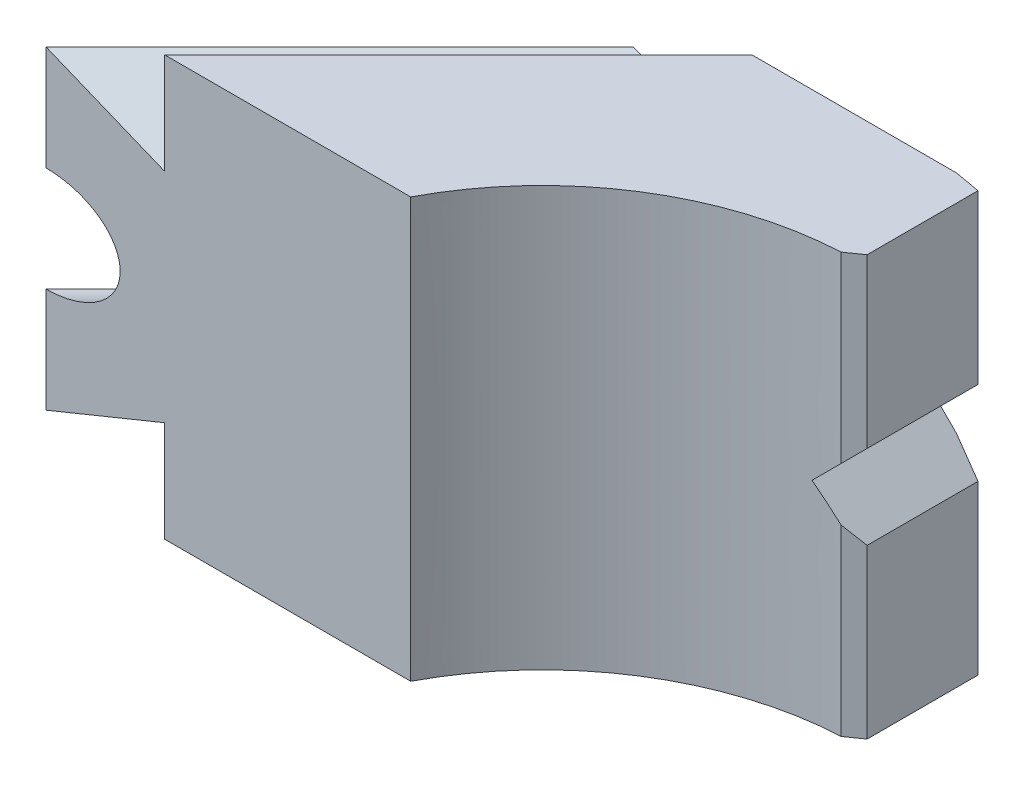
ISO-10303-21;
HEADER;
FILE_DESCRIPTION(('STEP AP214'),'2;1');
FILE_NAME('part.step','',(''),(''),'','','');
FILE_SCHEMA(('AUTOMOTIVE_DESIGN { 1 0 10303 214 1 1 1 1 }'));
ENDSEC;
DATA;
#1=APPLICATION_CONTEXT('core data for automotive mechanical design processes');
#2=APPLICATION_PROTOCOL_DEFINITION('international standard','automotive_design',2000,#1);
#3=PRODUCT_CONTEXT('',#1,'mechanical');
#4=PRODUCT('Part','Part','',(#3));
#5=PRODUCT_RELATED_PRODUCT_CATEGORY('part','',(#4));
#6=PRODUCT_DEFINITION_FORMATION('','',#4);
#7=PRODUCT_DEFINITION_CONTEXT('part definition',#1,'design');
#8=PRODUCT_DEFINITION('design','',#6,#7);
#9=PRODUCT_DEFINITION_SHAPE('','',#8);
#10=(LENGTH_UNIT() NAMED_UNIT(*) SI_UNIT(.MILLI.,.METRE.));
#11=(NAMED_UNIT(*) PLANE_ANGLE_UNIT() SI_UNIT($,.RADIAN.));
#12=(NAMED_UNIT(*) SI_UNIT($,.STERADIAN.) SOLID_ANGLE_UNIT());
#13=UNCERTAINTY_MEASURE_WITH_UNIT(LENGTH_MEASURE(1.E-05),#10,'distance_accuracy_value','');
#14=(GEOMETRIC_REPRESENTATION_CONTEXT(3) GLOBAL_UNCERTAINTY_ASSIGNED_CONTEXT((#13)) GLOBAL_UNIT_ASSIGNED_CONTEXT((#10,
#11,#12)) REPRESENTATION_CONTEXT('',''));
#15=CARTESIAN_POINT('',(0.,0.,0.));
#16=DIRECTION('',(0.,0.,1.));
#17=DIRECTION('',(1.,0.,0.));
#18=AXIS2_PLACEMENT_3D('',#15,#16,#17);
#19=CARTESIAN_POINT('',(-184.366342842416,-15.0000000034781,184.366326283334));
#20=DIRECTION('',(-0.353553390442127,0.866025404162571,-0.35355338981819));
#21=DIRECTION('',(-0.925820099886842,-0.377964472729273,0.));
#22=AXIS2_PLACEMENT_3D('',#19,#20,#21);
#23=PLANE('',#22);
#24=CARTESIAN_POINT('',(2.53718675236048E-05,-14.999960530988,5.034361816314E-08));
#25=DIRECTION('',(-0.707106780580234,-9.96744242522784E-07,0.707106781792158));
#26=VECTOR('',#25,1.);
#27=LINE('',#24,#26);
#28=CARTESIAN_POINT('',(-1.06102236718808E-06,-14.9999802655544,-5.23843562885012E-06));
#29=VERTEX_POINT('',#28);
#30=CARTESIAN_POINT('',(-15.7320270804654,-14.9999827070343,15.73205252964));
#31=VERTEX_POINT('',#30);
#32=EDGE_CURVE('E591',#29,#31,#27,.T.);
#33=ORIENTED_EDGE('',*,*,#32,.F.);
#34=DIRECTION('',(-0.925820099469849,-0.377964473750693,8.41381464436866E-10));
#35=VECTOR('',#34,1.);
#36=CARTESIAN_POINT('',(11.3136915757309,-10.3811978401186,-1.02818348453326E-08));
#37=LINE('',#36,#35);
#38=CARTESIAN_POINT('',(11.3136916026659,-10.3811978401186,4.18899450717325E-08));
#39=VERTEX_POINT('',#38);
#40=EDGE_CURVE('E912',#39,#29,#37,.T.);
#41=ORIENTED_EDGE('',*,*,#40,.F.);
#42=DIRECTION('',(0.707106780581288,1.52498014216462E-11,-0.707106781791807));
#43=VECTOR('',#42,1.);
#44=CARTESIAN_POINT('',(-178.709488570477,-10.3811978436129,190.023180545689));
#45=LINE('',#44,#43);
#46=CARTESIAN_POINT('',(-16.686308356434,-10.3811978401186,28.0000000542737));
#47=VERTEX_POINT('',#46);
#48=EDGE_CURVE('E796',#47,#39,#45,.T.);
#49=ORIENTED_EDGE('',*,*,#48,.F.);
#50=DIRECTION('',(0.925820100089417,0.37796447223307,-8.25270128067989E-10));
#51=VECTOR('',#50,1.);
#52=CARTESIAN_POINT('',(-28.000016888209,-15.0000000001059,28.000000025));
#53=LINE('',#52,#51);
#54=CARTESIAN_POINT('',(-28.0000124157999,-15.0000000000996,28.0000045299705));
#55=VERTEX_POINT('',#54);
#56=EDGE_CURVE('E892',#55,#47,#53,.T.);
#57=ORIENTED_EDGE('',*,*,#56,.F.);
#58=CARTESIAN_POINT('',(-15.7518386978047,-14.9999827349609,15.7518641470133));
#59=DIRECTION('',(-0.707106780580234,-9.96744243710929E-07,0.707106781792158));
#60=VECTOR('',#59,1.);
#61=LINE('',#58,#60);
#62=CARTESIAN_POINT('',(-15.7518455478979,-14.9999855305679,15.7518572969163));
#63=VERTEX_POINT('',#62);
#64=EDGE_CURVE('E25',#63,#55,#61,.T.);
#65=ORIENTED_EDGE('',*,*,#64,.F.);
#66=CARTESIAN_POINT('',(-15.7320270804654,-14.9999827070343,15.73205252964));
#67=DIRECTION('',(-0.707106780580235,-9.96744669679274E-07,0.707106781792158));
#68=VECTOR('',#67,1.);
#69=LINE('',#66,#68);
#70=EDGE_CURVE('E9',#31,#63,#69,.T.);
#71=ORIENTED_EDGE('',*,*,#70,.F.);
#72=EDGE_LOOP('',(#33,#41,#49,#57,#65,#71));
#73=FACE_BOUND('',#72,.T.);
#74=ADVANCED_FACE('F14',(#73),#23,.F.);
#75=CARTESIAN_POINT('',(-28.603691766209,-7.14331507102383,13.322745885));
#76=DIRECTION('',(-0.707106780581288,-1.52498014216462E-11,0.707106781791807));
#77=DIRECTION('',(0.692798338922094,-0.200152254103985,0.692798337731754));
#78=AXIS2_PLACEMENT_3D('',#75,#76,#77);
#79=PLANE('',#78);
#80=CARTESIAN_POINT('',(-20.3095326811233,4.52533979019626,21.6169049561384));
#81=DIRECTION('',(0.529216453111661,-0.663219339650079,0.529216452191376));
#82=VECTOR('',#81,1.);
#83=LINE('',#80,#82);
#84=CARTESIAN_POINT('',(-20.3095326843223,4.52533979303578,21.6169049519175));
#85=VERTEX_POINT('',#84);
#86=CARTESIAN_POINT('',(-17.8651865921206,1.46206088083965,24.0612510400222));
#87=VERTEX_POINT('',#86);
#88=EDGE_CURVE('E1256',#85,#87,#83,.T.);
#89=ORIENTED_EDGE('',*,*,#88,.T.);
#90=CARTESIAN_POINT('',(-17.8651865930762,1.46206087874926,24.0612510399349));
#91=DIRECTION('',(-0.141529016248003,-0.97976480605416,-0.141529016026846));
#92=VECTOR('',#91,1.);
#93=LINE('',#90,#92);
#94=CARTESIAN_POINT('',(-18.5188811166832,-3.06327891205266,23.4075565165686));
#95=VERTEX_POINT('',#94);
#96=EDGE_CURVE('E1504',#87,#95,#93,.T.);
#97=ORIENTED_EDGE('',*,*,#96,.T.);
#98=CARTESIAN_POINT('',(-18.518881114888,-3.06327891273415,23.4075565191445));
#99=DIRECTION('',(-0.670745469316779,-0.316545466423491,-0.670745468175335));
#100=VECTOR('',#99,1.);
#101=LINE('',#98,#100);
#102=CARTESIAN_POINT('',(-21.6169217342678,-4.52533979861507,20.3095159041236));
#103=VERTEX_POINT('',#102);
#104=EDGE_CURVE('E1515',#95,#103,#101,.T.);
#105=ORIENTED_EDGE('',*,*,#104,.T.);
#106=CARTESIAN_POINT('',(-21.6169217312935,-4.52533980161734,20.3095159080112));
#107=DIRECTION('',(-0.529216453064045,0.66321933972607,-0.529216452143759));
#108=VECTOR('',#107,1.);
#109=LINE('',#106,#108);
#110=CARTESIAN_POINT('',(-24.061267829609,-1.46206087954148,17.8651698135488));
#111=VERTEX_POINT('',#110);
#112=EDGE_CURVE('E1527',#103,#111,#109,.T.);
#113=ORIENTED_EDGE('',*,*,#112,.T.);
#114=CARTESIAN_POINT('',(-24.0612678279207,-1.46206087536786,17.8651698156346));
#115=DIRECTION('',(0.141529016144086,0.979764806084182,0.141529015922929));
#116=VECTOR('',#115,1.);
#117=LINE('',#114,#116);
#118=CARTESIAN_POINT('',(-23.4075733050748,3.06327891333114,18.5188643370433));
#119=VERTEX_POINT('',#118);
#120=EDGE_CURVE('E1539',#111,#119,#117,.T.);
#121=ORIENTED_EDGE('',*,*,#120,.T.);
#122=CARTESIAN_POINT('',(-23.4075733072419,3.0632789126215,18.5188643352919));
#123=DIRECTION('',(0.670745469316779,0.31654546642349,0.670745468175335));
#124=VECTOR('',#123,1.);
#125=LINE('',#122,#124);
#126=EDGE_CURVE('E1551',#119,#85,#125,.T.);
#127=ORIENTED_EDGE('',*,*,#126,.T.);
#128=EDGE_LOOP('',(#89,#97,#105,#113,#121,#127));
#129=FACE_BOUND('',#128,.T.);
#130=DIRECTION('',(7.04839647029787E-07,-0.999999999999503,7.04769582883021E-07));
#131=VECTOR('',#130,1.);
#132=CARTESIAN_POINT('',(-20.9632229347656,8.89999999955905,20.9632147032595));
#133=LINE('',#132,#131);
#134=CARTESIAN_POINT('',(-20.9632229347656,8.89999999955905,20.9632147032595));
#135=VERTEX_POINT('',#134);
#136=CARTESIAN_POINT('',(-20.963220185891,4.99999999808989,20.9632174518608));
#137=VERTEX_POINT('',#136);
#138=EDGE_CURVE('E1264',#135,#137,#133,.T.);
#139=ORIENTED_EDGE('',*,*,#138,.F.);
#140=CARTESIAN_POINT('',(-20.9632229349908,8.89999999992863,20.9632147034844));
#141=CARTESIAN_POINT('',(-21.3764885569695,8.89996427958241,20.5499490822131));
#142=CARTESIAN_POINT('',(-21.7859141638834,8.84289932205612,20.140523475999));
#143=CARTESIAN_POINT('',(-22.5960532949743,8.61507626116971,19.33038434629));
#144=CARTESIAN_POINT('',(-22.9899816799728,8.44600667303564,18.9364559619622));
#145=CARTESIAN_POINT('',(-23.7531260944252,7.9990442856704,18.1733115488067));
#146=CARTESIAN_POINT('',(-24.1161621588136,7.72453872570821,17.8102754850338));
#147=CARTESIAN_POINT('',(-24.8029846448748,7.07561352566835,17.1234530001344));
#148=CARTESIAN_POINT('',(-25.1211771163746,6.7062210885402,16.8052605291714));
#149=CARTESIAN_POINT('',(-25.7052834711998,5.88027090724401,16.2211541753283));
#150=CARTESIAN_POINT('',(-25.9664043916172,5.43018713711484,15.9600332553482));
#151=CARTESIAN_POINT('',(-26.4253477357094,4.45895277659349,15.5010899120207));
#152=CARTESIAN_POINT('',(-26.6193623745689,3.94547414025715,15.3070752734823));
#153=CARTESIAN_POINT('',(-26.9355057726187,2.86627959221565,14.9909318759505));
#154=CARTESIAN_POINT('',(-27.0549582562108,2.30913878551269,14.8714793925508));
#155=CARTESIAN_POINT('',(-27.2161524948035,1.16345689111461,14.7102851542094));
#156=CARTESIAN_POINT('',(-27.2564523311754,0.584064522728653,14.669985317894));
#157=CARTESIAN_POINT('',(-27.2565028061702,-0.584076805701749,14.6699348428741));
#158=CARTESIAN_POINT('',(-27.2161012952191,-1.16345501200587,14.7103363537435));
#159=CARTESIAN_POINT('',(-27.0550060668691,-2.30916475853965,14.871431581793));
#160=CARTESIAN_POINT('',(-26.9354558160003,-2.86626362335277,14.9909818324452));
#161=CARTESIAN_POINT('',(-26.6194056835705,-3.94551280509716,15.3070319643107));
#162=CARTESIAN_POINT('',(-26.4253009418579,-4.45892333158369,15.5011367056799));
#163=CARTESIAN_POINT('',(-25.9664415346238,-5.43023700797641,15.9599961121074));
#164=CARTESIAN_POINT('',(-25.7052416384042,-5.88022911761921,16.2211960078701));
#165=CARTESIAN_POINT('',(-25.1212066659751,-6.70628024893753,16.8052309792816));
#166=CARTESIAN_POINT('',(-24.802949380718,-7.07556099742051,17.123488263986));
#167=CARTESIAN_POINT('',(-24.1161829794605,-7.72460490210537,17.8102546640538));
#168=CARTESIAN_POINT('',(-23.7530987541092,-7.9989830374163,18.1733388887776));
#169=CARTESIAN_POINT('',(-22.9899929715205,-8.44607732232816,18.9364446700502));
#170=CARTESIAN_POINT('',(-22.5960349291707,-8.61500864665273,19.3304027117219));
#171=CARTESIAN_POINT('',(-21.7859154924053,-8.8429717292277,20.1405221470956));
#172=CARTESIAN_POINT('',(-21.3767531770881,-8.8999642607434,20.549684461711));
#173=CARTESIAN_POINT('',(-20.9632228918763,-8.89999999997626,20.9632147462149));
#174=B_SPLINE_CURVE_WITH_KNOTS('',3,(#140,#141,#142,#143,#144,#145,#146,#147,#148,#149,#150,
#151,#152,#153,#154,#155,#156,#157,#158,#159,#160,#161,#162,#163,#164,#165,#166,#167,#168,#169,
#170,#171,#172,#173),.UNSPECIFIED.,.F.,.F.,(4,2,2,2,2,2,2,2,2,2,2,2,2,2,2,2,4),(0.,0.0625,0.125,
0.1875,0.25,0.3125,0.375,0.4375,0.5,0.5625,0.625,0.6875,0.75,0.8125,0.875,0.9375,1.),.UNSPECIFIED.);
#175=CARTESIAN_POINT('',(-20.9632166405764,-8.89999999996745,20.9632209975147));
#176=VERTEX_POINT('',#175);
#177=EDGE_CURVE('E1269',#176,#135,#174,.F.);
#178=ORIENTED_EDGE('',*,*,#177,.F.);
#179=DIRECTION('',(7.04802753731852E-07,-0.999999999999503,7.04806474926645E-07));
#180=VECTOR('',#179,1.);
#181=CARTESIAN_POINT('',(-20.9632131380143,-4.99999008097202,20.9632245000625));
#182=LINE('',#181,#180);
#183=CARTESIAN_POINT('',(-20.9632131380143,-4.99999008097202,20.9632245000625));
#184=VERTEX_POINT('',#183);
#185=EDGE_CURVE('E1407',#184,#176,#182,.T.);
#186=ORIENTED_EDGE('',*,*,#185,.F.);
#187=CARTESIAN_POINT('',(-20.9632272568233,-2.38333658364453E-11,20.9632103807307));
#188=DIRECTION('',(0.707106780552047,0.,-0.707106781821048));
#189=DIRECTION('',(0.707106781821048,-1.79586368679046E-10,0.707106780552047));
#190=AXIS2_PLACEMENT_3D('',#187,#188,#189);
#191=CIRCLE('',#190,4.99999999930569);
#192=CARTESIAN_POINT('',(-17.4276933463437,1.70710319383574E-09,24.4987442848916));
#193=VERTEX_POINT('',#192);
#194=EDGE_CURVE('E1562',#184,#193,#191,.F.);
#195=ORIENTED_EDGE('',*,*,#194,.T.);
#196=CARTESIAN_POINT('',(-20.9632272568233,-2.38333658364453E-11,20.9632103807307));
#197=DIRECTION('',(0.707106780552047,0.,-0.707106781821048));
#198=DIRECTION('',(-1.45029821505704E-10,1.,-1.45029821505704E-10));
#199=AXIS2_PLACEMENT_3D('',#196,#197,#198);
#200=CIRCLE('',#199,4.99999999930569);
#201=EDGE_CURVE('E1273',#193,#137,#200,.F.);
#202=ORIENTED_EDGE('',*,*,#201,.T.);
#203=EDGE_LOOP('',(#139,#178,#186,#195,#202));
#204=FACE_BOUND('',#203,.T.);
#205=ADVANCED_FACE('F16',(#129,#204),#79,.T.);
#206=CARTESIAN_POINT('',(-184.366338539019,8.8999999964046,184.366330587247));
#207=CARTESIAN_POINT('',(-184.779604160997,8.89996427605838,183.953064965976));
#208=CARTESIAN_POINT('',(-185.189029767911,8.84289931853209,183.543639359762));
#209=CARTESIAN_POINT('',(-185.999168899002,8.61507625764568,182.733500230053));
#210=CARTESIAN_POINT('',(-186.393097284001,8.44600666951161,182.339571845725));
#211=CARTESIAN_POINT('',(-187.156241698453,7.99904428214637,181.576427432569));
#212=CARTESIAN_POINT('',(-187.519277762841,7.72453872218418,181.213391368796));
#213=CARTESIAN_POINT('',(-188.206100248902,7.07561352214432,180.526568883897));
#214=CARTESIAN_POINT('',(-188.524292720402,6.70622108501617,180.208376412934));
#215=CARTESIAN_POINT('',(-189.108399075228,5.88027090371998,179.624270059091));
#216=CARTESIAN_POINT('',(-189.369519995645,5.43018713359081,179.363149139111));
#217=CARTESIAN_POINT('',(-189.828463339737,4.45895277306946,178.904205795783));
#218=CARTESIAN_POINT('',(-190.022477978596,3.94547413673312,178.710191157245));
#219=CARTESIAN_POINT('',(-190.338621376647,2.86627958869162,178.394047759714));
#220=CARTESIAN_POINT('',(-190.458073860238,2.30913878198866,178.274595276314));
#221=CARTESIAN_POINT('',(-190.619268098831,1.16345688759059,178.113401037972));
#222=CARTESIAN_POINT('',(-190.659567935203,0.584064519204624,178.073101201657));
#223=CARTESIAN_POINT('',(-190.659618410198,-0.584076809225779,178.073050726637));
#224=CARTESIAN_POINT('',(-190.619216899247,-1.1634550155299,178.113452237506));
#225=CARTESIAN_POINT('',(-190.458121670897,-2.30916476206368,178.274547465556));
#226=CARTESIAN_POINT('',(-190.338571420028,-2.8662636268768,178.394097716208));
#227=CARTESIAN_POINT('',(-190.022521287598,-3.94551280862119,178.710147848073));
#228=CARTESIAN_POINT('',(-189.828416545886,-4.45892333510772,178.904252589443));
#229=CARTESIAN_POINT('',(-189.369557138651,-5.43023701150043,179.36311199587));
#230=CARTESIAN_POINT('',(-189.108357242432,-5.88022912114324,179.624311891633));
#231=CARTESIAN_POINT('',(-188.524322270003,-6.70628025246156,180.208346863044));
#232=CARTESIAN_POINT('',(-188.206064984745,-7.07556100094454,180.526604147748));
#233=CARTESIAN_POINT('',(-187.519298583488,-7.7246049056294,181.213370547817));
#234=CARTESIAN_POINT('',(-187.156214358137,-7.99898304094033,181.576454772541));
#235=CARTESIAN_POINT('',(-186.393108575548,-8.44607732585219,182.339560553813));
#236=CARTESIAN_POINT('',(-185.999150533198,-8.61500865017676,182.733518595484));
#237=CARTESIAN_POINT('',(-185.189031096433,-8.84297173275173,183.543638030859));
#238=CARTESIAN_POINT('',(-184.779868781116,-8.89996426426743,183.952800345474));
#239=CARTESIAN_POINT('',(-184.366338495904,-8.90000000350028,184.366330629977));
#240=CARTESIAN_POINT('',(-184.30017365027,-8.90000572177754,184.432495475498));
#241=CARTESIAN_POINT('',(-184.234008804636,-8.9000114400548,184.498660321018));
#242=CARTESIAN_POINT('',(-184.167843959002,-8.90001715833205,184.564825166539));
#243=B_SPLINE_CURVE_WITH_KNOTS('',3,(#206,#207,#208,#209,#210,#211,#212,#213,#214,#215,#216,
#217,#218,#219,#220,#221,#222,#223,#224,#225,#226,#227,#228,#229,#230,#231,#232,#233,#234,#235,
#236,#237,#238,#239,#240,#241,#242),.UNSPECIFIED.,.F.,.F.,(4,2,2,2,2,2,2,2,2,2,2,2,2,2,2,2,3,4),
(0.,0.0625,0.125,0.1875,0.25,0.3125,0.375,0.4375,0.5,0.5625,0.625,0.6875,0.75,0.8125,0.875,
0.9375,1.,1.01),.UNSPECIFIED.);
#244=DIRECTION('',(0.707106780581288,1.52498014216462E-11,-0.707106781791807));
#245=VECTOR('',#244,1.);
#246=SURFACE_OF_LINEAR_EXTRUSION('',#243,#245);
#247=CARTESIAN_POINT('',(-6.82108732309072,8.90000000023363,6.82107906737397));
#248=CARTESIAN_POINT('',(-7.23435294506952,8.89996427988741,6.40781344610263));
#249=CARTESIAN_POINT('',(-7.64377855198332,8.84289932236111,5.99838783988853));
#250=CARTESIAN_POINT('',(-8.45391768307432,8.6150762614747,5.18824871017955));
#251=CARTESIAN_POINT('',(-8.84784606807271,8.44600667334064,4.7943203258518));
#252=CARTESIAN_POINT('',(-9.61099048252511,7.99904428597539,4.03117591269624));
#253=CARTESIAN_POINT('',(-9.97402654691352,7.7245387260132,3.6681398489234));
#254=CARTESIAN_POINT('',(-10.6608490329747,7.07561352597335,2.98131736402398));
#255=CARTESIAN_POINT('',(-10.9790415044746,6.70622108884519,2.66312489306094));
#256=CARTESIAN_POINT('',(-11.5631478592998,5.88027090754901,2.07901853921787));
#257=CARTESIAN_POINT('',(-11.8242687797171,5.43018713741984,1.81789761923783));
#258=CARTESIAN_POINT('',(-12.2832121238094,4.45895277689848,1.3589542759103));
#259=CARTESIAN_POINT('',(-12.4772267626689,3.94547414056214,1.16493963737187));
#260=CARTESIAN_POINT('',(-12.7933701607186,2.86627959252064,0.848796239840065));
#261=CARTESIAN_POINT('',(-12.9128226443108,2.30913878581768,0.729343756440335));
#262=CARTESIAN_POINT('',(-13.0740168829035,1.16345689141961,0.56814951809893));
#263=CARTESIAN_POINT('',(-13.1143167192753,0.584064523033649,0.52784968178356));
#264=CARTESIAN_POINT('',(-13.1143671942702,-0.584076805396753,0.527799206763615));
#265=CARTESIAN_POINT('',(-13.0739656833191,-1.16345501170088,0.56820071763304));
#266=CARTESIAN_POINT('',(-12.9128704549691,-2.30916475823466,0.729295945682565));
#267=CARTESIAN_POINT('',(-12.7933202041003,-2.86626362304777,0.8488461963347));
#268=CARTESIAN_POINT('',(-12.4772700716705,-3.94551280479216,1.1648963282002));
#269=CARTESIAN_POINT('',(-12.2831653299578,-4.45892333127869,1.35900106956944));
#270=CARTESIAN_POINT('',(-11.8243059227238,-5.43023700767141,1.81786047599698));
#271=CARTESIAN_POINT('',(-11.5631060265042,-5.88022911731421,2.07906037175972));
#272=CARTESIAN_POINT('',(-10.979071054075,-6.70628024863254,2.66309534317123));
#273=CARTESIAN_POINT('',(-10.6608137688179,-7.07556099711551,2.98135262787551));
#274=CARTESIAN_POINT('',(-9.97404736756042,-7.72460490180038,3.66811902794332));
#275=CARTESIAN_POINT('',(-9.61096314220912,-7.99898303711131,4.03120325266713));
#276=CARTESIAN_POINT('',(-8.84785735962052,-8.44607732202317,4.79430903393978));
#277=CARTESIAN_POINT('',(-8.45389931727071,-8.61500864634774,5.18826707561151));
#278=CARTESIAN_POINT('',(-7.64377988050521,-8.8429717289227,5.99838651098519));
#279=CARTESIAN_POINT('',(-7.23461756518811,-8.89996426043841,6.40754882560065));
#280=CARTESIAN_POINT('',(-6.82108727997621,-8.89999999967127,6.82107911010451));
#281=B_SPLINE_CURVE_WITH_KNOTS('',3,(#247,#248,#249,#250,#251,#252,#253,#254,#255,#256,#257,
#258,#259,#260,#261,#262,#263,#264,#265,#266,#267,#268,#269,#270,#271,#272,#273,#274,#275,#276,
#277,#278,#279,#280),.UNSPECIFIED.,.F.,.F.,(4,2,2,2,2,2,2,2,2,2,2,2,2,2,2,2,4),(0.,0.0625,0.125,
0.1875,0.25,0.3125,0.375,0.4375,0.5,0.5625,0.625,0.6875,0.75,0.8125,0.875,0.9375,1.),.UNSPECIFIED.);
#282=CARTESIAN_POINT('',(-6.82108946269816,-8.90000498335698,6.82107692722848));
#283=VERTEX_POINT('',#282);
#284=CARTESIAN_POINT('',(-6.82108732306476,8.90000000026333,6.82107906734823));
#285=VERTEX_POINT('',#284);
#286=EDGE_CURVE('E513',#283,#285,#281,.F.);
#287=ORIENTED_EDGE('',*,*,#286,.F.);
#288=DIRECTION('',(0.707106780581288,0.,-0.707106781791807));
#289=VECTOR('',#288,1.);
#290=CARTESIAN_POINT('',(-27.093145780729,-8.89999999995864,27.0931626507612));
#291=LINE('',#290,#289);
#292=EDGE_CURVE('E835',#176,#283,#291,.T.);
#293=ORIENTED_EDGE('',*,*,#292,.F.);
#294=ORIENTED_EDGE('',*,*,#177,.T.);
#295=DIRECTION('',(0.707106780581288,1.52498014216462E-11,-0.707106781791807));
#296=VECTOR('',#295,1.);
#297=CARTESIAN_POINT('',(-184.366338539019,8.8999999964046,184.366330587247));
#298=LINE('',#297,#296);
#299=EDGE_CURVE('E836',#135,#285,#298,.T.);
#300=ORIENTED_EDGE('',*,*,#299,.T.);
#301=EDGE_LOOP('',(#287,#293,#294,#300));
#302=FACE_BOUND('',#301,.T.);
#303=ADVANCED_FACE('F610',(#302),#246,.F.);
#304=CARTESIAN_POINT('',(-178.709488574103,19.9999999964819,190.023180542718));
#305=DIRECTION('',(0.707106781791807,-1.54113073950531E-10,0.707106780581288));
#306=DIRECTION('',(-0.707106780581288,0.,0.707106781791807));
#307=AXIS2_PLACEMENT_3D('',#304,#305,#306);
#308=PLANE('',#307);
#309=DIRECTION('',(0.707106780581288,1.52498014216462E-11,-0.707106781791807));
#310=VECTOR('',#309,1.);
#311=CARTESIAN_POINT('',(-178.709488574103,19.9999999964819,190.023180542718));
#312=LINE('',#311,#310);
#313=CARTESIAN_POINT('',(-16.6863083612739,19.9999999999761,28.0000000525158));
#314=VERTEX_POINT('',#313);
#315=CARTESIAN_POINT('',(11.3136915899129,19.9999999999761,4.25932999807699E-08));
#316=VERTEX_POINT('',#315);
#317=EDGE_CURVE('E577',#314,#316,#312,.T.);
#318=ORIENTED_EDGE('',*,*,#317,.T.);
#319=CARTESIAN_POINT('',(11.313691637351,10.3811978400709,-1.0281835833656E-08));
#320=DIRECTION('',(0.,1.,0.));
#321=VECTOR('',#320,1.);
#322=LINE('',#319,#321);
#323=CARTESIAN_POINT('',(11.3136916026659,10.381197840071,4.18899450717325E-08));
#324=VERTEX_POINT('',#323);
#325=EDGE_CURVE('E182',#324,#316,#322,.T.);
#326=ORIENTED_EDGE('',*,*,#325,.F.);
#327=DIRECTION('',(0.707106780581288,1.52498014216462E-11,-0.707106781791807));
#328=VECTOR('',#327,1.);
#329=CARTESIAN_POINT('',(-178.709488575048,10.3811978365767,190.023180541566));
#330=LINE('',#329,#328);
#331=CARTESIAN_POINT('',(-16.6863083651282,10.381197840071,28.0000000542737));
#332=VERTEX_POINT('',#331);
#333=EDGE_CURVE('E860',#332,#324,#330,.T.);
#334=ORIENTED_EDGE('',*,*,#333,.F.);
#335=CARTESIAN_POINT('',(-16.6863083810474,19.9999999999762,28.000000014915));
#336=DIRECTION('',(0.,-1.,0.));
#337=VECTOR('',#336,1.);
#338=LINE('',#335,#337);
#339=EDGE_CURVE('E877',#314,#332,#338,.T.);
#340=ORIENTED_EDGE('',*,*,#339,.F.);
#341=EDGE_LOOP('',(#318,#326,#334,#340));
#342=FACE_BOUND('',#341,.T.);
#343=ADVANCED_FACE('F646',(#342),#308,.F.);
#344=CARTESIAN_POINT('',(-178.709488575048,10.3811978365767,190.023180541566));
#345=DIRECTION('',(-0.353553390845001,-0.866025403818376,-0.353553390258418));
#346=DIRECTION('',(0.925820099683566,-0.377964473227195,0.));
#347=AXIS2_PLACEMENT_3D('',#344,#345,#346);
#348=PLANE('',#347);
#349=ORIENTED_EDGE('',*,*,#333,.T.);
#350=DIRECTION('',(0.925820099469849,-0.377964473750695,-8.41381464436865E-10));
#351=VECTOR('',#350,1.);
#352=CARTESIAN_POINT('',(-1.6913209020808E-05,15.0000000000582,0.));
#353=LINE('',#352,#351);
#354=CARTESIAN_POINT('',(-1.69163536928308E-05,15.0000000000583,5.03436493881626E-08));
#355=VERTEX_POINT('',#354);
#356=EDGE_CURVE('E917',#355,#324,#353,.T.);
#357=ORIENTED_EDGE('',*,*,#356,.F.);
#358=CARTESIAN_POINT('',(-28.0000380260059,14.9999605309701,28.0000212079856));
#359=DIRECTION('',(0.707106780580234,9.96744243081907E-07,-0.707106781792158));
#360=VECTOR('',#359,1.);
#361=LINE('',#358,#360);
#362=CARTESIAN_POINT('',(-28.0000240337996,14.9999732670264,28.0000072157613));
#363=VERTEX_POINT('',#362);
#364=EDGE_CURVE('E634',#363,#355,#361,.T.);
#365=ORIENTED_EDGE('',*,*,#364,.F.);
#366=DIRECTION('',(-0.925820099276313,0.377964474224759,8.25270132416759E-10));
#367=VECTOR('',#366,1.);
#368=CARTESIAN_POINT('',(-16.6863083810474,10.381197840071,28.000000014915));
#369=LINE('',#368,#367);
#370=EDGE_CURVE('E883',#332,#363,#369,.T.);
#371=ORIENTED_EDGE('',*,*,#370,.F.);
#372=EDGE_LOOP('',(#349,#357,#365,#371));
#373=FACE_BOUND('',#372,.T.);
#374=ADVANCED_FACE('F637',(#373),#348,.F.);
#375=CARTESIAN_POINT('',(-178.709488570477,-10.3811978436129,190.023180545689));
#376=DIRECTION('',(0.707106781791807,-4.85027904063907E-10,0.707106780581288));
#377=DIRECTION('',(-0.707106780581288,0.,0.707106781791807));
#378=AXIS2_PLACEMENT_3D('',#375,#376,#377);
#379=PLANE('',#378);
#380=ORIENTED_EDGE('',*,*,#48,.T.);
#381=CARTESIAN_POINT('',(11.313691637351,-20.0000000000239,-1.0281835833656E-08));
#382=DIRECTION('',(0.,1.,0.));
#383=VECTOR('',#382,1.);
#384=LINE('',#381,#383);
#385=CARTESIAN_POINT('',(11.3136915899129,-20.0000000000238,4.25933051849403E-08));
#386=VERTEX_POINT('',#385);
#387=EDGE_CURVE('E98',#386,#39,#384,.T.);
#388=ORIENTED_EDGE('',*,*,#387,.F.);
#389=DIRECTION('',(0.707106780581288,1.52498014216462E-11,-0.707106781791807));
#390=VECTOR('',#389,1.);
#391=CARTESIAN_POINT('',(-178.709488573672,-20.0000000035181,190.023180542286));
#392=LINE('',#391,#390);
#393=CARTESIAN_POINT('',(-16.6863083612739,-20.0000000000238,28.0000000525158));
#394=VERTEX_POINT('',#393);
#395=EDGE_CURVE('E832',#394,#386,#392,.T.);
#396=ORIENTED_EDGE('',*,*,#395,.F.);
#397=CARTESIAN_POINT('',(-16.6863083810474,-10.3811978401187,28.000000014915));
#398=DIRECTION('',(0.,-1.,0.));
#399=VECTOR('',#398,1.);
#400=LINE('',#397,#399);
#401=EDGE_CURVE('E846',#47,#394,#400,.T.);
#402=ORIENTED_EDGE('',*,*,#401,.F.);
#403=EDGE_LOOP('',(#380,#388,#396,#402));
#404=FACE_BOUND('',#403,.T.);
#405=ADVANCED_FACE('F607',(#404),#379,.F.);
#406=CARTESIAN_POINT('',(33.309983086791,-20.0000000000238,0.440817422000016));
#407=DIRECTION('',(0.173648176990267,0.,-0.984807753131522));
#408=DIRECTION('',(-0.984807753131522,0.,-0.173648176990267));
#409=AXIS2_PLACEMENT_3D('',#406,#407,#408);
#410=PLANE('',#409);
#411=DIRECTION('',(0.984807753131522,0.,0.173648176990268));
#412=VECTOR('',#411,1.);
#413=CARTESIAN_POINT('',(30.8099831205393,-20.0000000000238,-2.20492348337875E-08));
#414=LINE('',#413,#412);
#415=CARTESIAN_POINT('',(30.8099830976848,-20.0000000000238,-2.39999847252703E-08));
#416=VERTEX_POINT('',#415);
#417=CARTESIAN_POINT('',(33.3099830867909,-20.0000000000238,0.44081742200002));
#418=VERTEX_POINT('',#417);
#419=EDGE_CURVE('E508',#416,#418,#414,.T.);
#420=ORIENTED_EDGE('',*,*,#419,.F.);
#421=CARTESIAN_POINT('',(30.809983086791,-1.5000000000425,-2.79999847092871E-08));
#422=DIRECTION('',(0.,-1.,0.));
#423=VECTOR('',#422,1.);
#424=LINE('',#421,#423);
#425=CARTESIAN_POINT('',(30.8099830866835,-1.50000000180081,-2.8041649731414E-08));
#426=VERTEX_POINT('',#425);
#427=EDGE_CURVE('E481',#426,#416,#424,.T.);
#428=ORIENTED_EDGE('',*,*,#427,.F.);
#429=DIRECTION('',(0.701673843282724,-0.701673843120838,0.123724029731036));
#430=VECTOR('',#429,1.);
#431=CARTESIAN_POINT('',(30.8099830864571,-1.49999999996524,-2.80588646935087E-08));
#432=LINE('',#431,#430);
#433=CARTESIAN_POINT('',(33.3099830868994,-4.00000000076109,0.440817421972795));
#434=VERTEX_POINT('',#433);
#435=EDGE_CURVE('E197',#426,#434,#432,.T.);
#436=ORIENTED_EDGE('',*,*,#435,.T.);
#437=DIRECTION('',(0.,1.,0.));
#438=VECTOR('',#437,1.);
#439=CARTESIAN_POINT('',(33.3099830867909,-20.0000000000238,0.440817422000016));
#440=LINE('',#439,#438);
#441=EDGE_CURVE('E511',#418,#434,#440,.T.);
#442=ORIENTED_EDGE('',*,*,#441,.F.);
#443=EDGE_LOOP('',(#420,#428,#436,#442));
#444=FACE_BOUND('',#443,.T.);
#445=ADVANCED_FACE('F541',(#444),#410,.T.);
#446=CARTESIAN_POINT('',(33.309983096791,-20.0000000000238,11.014826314));
#447=DIRECTION('',(1.,0.,-1.00000563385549E-09));
#448=DIRECTION('',(-1.00000563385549E-09,0.,-1.));
#449=AXIS2_PLACEMENT_3D('',#446,#447,#448);
#450=PLANE('',#449);
#451=DIRECTION('',(0.,0.,-1.));
#452=VECTOR('',#451,1.);
#453=CARTESIAN_POINT('',(33.3099830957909,-20.0000000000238,28.000000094));
#454=LINE('',#453,#452);
#455=CARTESIAN_POINT('',(33.3099830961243,-20.0000000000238,10.0148263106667));
#456=VERTEX_POINT('',#455);
#457=CARTESIAN_POINT('',(33.309983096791,-20.0000000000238,11.0148263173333));
#458=VERTEX_POINT('',#457);
#459=EDGE_CURVE('E489',#456,#458,#454,.F.);
#460=ORIENTED_EDGE('',*,*,#459,.F.);
#461=DIRECTION('',(6.30479418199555E-10,0.,1.));
#462=VECTOR('',#461,1.);
#463=CARTESIAN_POINT('',(33.3099830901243,-20.0000000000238,0.440817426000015));
#464=LINE('',#463,#462);
#465=CARTESIAN_POINT('',(33.3099830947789,-20.0000000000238,7.82349001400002));
#466=VERTEX_POINT('',#465);
#467=EDGE_CURVE('E808',#466,#456,#464,.T.);
#468=ORIENTED_EDGE('',*,*,#467,.F.);
#469=DIRECTION('',(0.,0.,-1.));
#470=VECTOR('',#469,1.);
#471=CARTESIAN_POINT('',(33.3099830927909,-20.0000000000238,28.000000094));
#472=LINE('',#471,#470);
#473=CARTESIAN_POINT('',(33.3099830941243,-20.0000000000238,6.82349001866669));
#474=VERTEX_POINT('',#473);
#475=EDGE_CURVE('E493',#474,#466,#472,.F.);
#476=ORIENTED_EDGE('',*,*,#475,.F.);
#477=CARTESIAN_POINT('',(33.3099830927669,-20.0000000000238,4.63215370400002));
#478=VERTEX_POINT('',#477);
#479=EDGE_CURVE('E1397',#478,#474,#464,.T.);
#480=ORIENTED_EDGE('',*,*,#479,.F.);
#481=DIRECTION('',(0.,0.,-1.));
#482=VECTOR('',#481,1.);
#483=CARTESIAN_POINT('',(33.3099830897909,-20.0000000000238,28.000000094));
#484=LINE('',#483,#482);
#485=CARTESIAN_POINT('',(33.3099830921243,-20.0000000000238,3.63215371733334));
#486=VERTEX_POINT('',#485);
#487=EDGE_CURVE('E498',#486,#478,#484,.F.);
#488=ORIENTED_EDGE('',*,*,#487,.F.);
#489=CARTESIAN_POINT('',(33.3099830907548,-20.0000000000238,1.44081742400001));
#490=VERTEX_POINT('',#489);
#491=EDGE_CURVE('E1396',#490,#486,#464,.T.);
#492=ORIENTED_EDGE('',*,*,#491,.F.);
#493=DIRECTION('',(0.,0.,-1.));
#494=VECTOR('',#493,1.);
#495=CARTESIAN_POINT('',(33.3099830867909,-20.0000000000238,28.000000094));
#496=LINE('',#495,#494);
#497=EDGE_CURVE('E503',#418,#490,#496,.F.);
#498=ORIENTED_EDGE('',*,*,#497,.F.);
#499=ORIENTED_EDGE('',*,*,#441,.T.);
#500=CARTESIAN_POINT('',(33.3099830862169,-4.00000000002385,0.440817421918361));
#501=DIRECTION('',(1.00000563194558E-09,0.,1.));
#502=VECTOR('',#501,1.);
#503=LINE('',#500,#502);
#504=CARTESIAN_POINT('',(33.3099830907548,-4.00000000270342,1.44081742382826));
#505=VERTEX_POINT('',#504);
#506=EDGE_CURVE('E326',#434,#505,#503,.T.);
#507=ORIENTED_EDGE('',*,*,#506,.T.);
#508=DIRECTION('',(-6.30479418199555E-10,-2.60822751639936E-10,-1.));
#509=VECTOR('',#508,1.);
#510=CARTESIAN_POINT('',(33.3099830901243,-4.00000000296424,0.440817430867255));
#511=LINE('',#510,#509);
#512=CARTESIAN_POINT('',(33.3099830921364,-4.00000000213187,3.63215372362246));
#513=VERTEX_POINT('',#512);
#514=EDGE_CURVE('E927',#513,#505,#511,.T.);
#515=ORIENTED_EDGE('',*,*,#514,.F.);
#516=CARTESIAN_POINT('',(33.3099830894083,-4.00000000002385,3.63215372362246));
#517=DIRECTION('',(1.00000564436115E-09,0.,1.));
#518=VECTOR('',#517,1.);
#519=LINE('',#516,#518);
#520=CARTESIAN_POINT('',(33.3099830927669,-4.00000000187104,4.63215371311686));
#521=VERTEX_POINT('',#520);
#522=EDGE_CURVE('E314',#513,#521,#519,.T.);
#523=ORIENTED_EDGE('',*,*,#522,.T.);
#524=CARTESIAN_POINT('',(33.3099830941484,-4.00000000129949,6.82349001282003));
#525=VERTEX_POINT('',#524);
#526=EDGE_CURVE('E926',#525,#521,#511,.T.);
#527=ORIENTED_EDGE('',*,*,#526,.F.);
#528=CARTESIAN_POINT('',(33.3099830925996,-4.00000000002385,6.82349001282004));
#529=DIRECTION('',(1.00000563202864E-09,0.,1.));
#530=VECTOR('',#529,1.);
#531=LINE('',#528,#530);
#532=CARTESIAN_POINT('',(33.3099830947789,-4.00000000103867,7.82349001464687));
#533=VERTEX_POINT('',#532);
#534=EDGE_CURVE('E300',#525,#533,#531,.T.);
#535=ORIENTED_EDGE('',*,*,#534,.T.);
#536=CARTESIAN_POINT('',(33.3099830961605,-4.00000000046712,10.0148263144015));
#537=VERTEX_POINT('',#536);
#538=EDGE_CURVE('E819',#537,#533,#511,.T.);
#539=ORIENTED_EDGE('',*,*,#538,.F.);
#540=CARTESIAN_POINT('',(33.309983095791,-4.00000000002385,10.0148263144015));
#541=DIRECTION('',(1.00000563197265E-09,0.,1.));
#542=VECTOR('',#541,1.);
#543=LINE('',#540,#542);
#544=CARTESIAN_POINT('',(33.3099830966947,-3.9999999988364,11.0148263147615));
#545=VERTEX_POINT('',#544);
#546=EDGE_CURVE('E286',#537,#545,#543,.T.);
#547=ORIENTED_EDGE('',*,*,#546,.T.);
#548=CARTESIAN_POINT('',(33.309983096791,-20.0000000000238,11.014826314));
#549=DIRECTION('',(0.,1.,0.));
#550=VECTOR('',#549,1.);
#551=LINE('',#548,#550);
#552=EDGE_CURVE('E59',#458,#545,#551,.T.);
#553=ORIENTED_EDGE('',*,*,#552,.F.);
#554=EDGE_LOOP('',(#460,#468,#476,#480,#488,#492,#498,#499,#507,#515,#523,#527,#535,#539,#547,#553));
#555=FACE_BOUND('',#554,.T.);
#556=ADVANCED_FACE('F532',(#555),#450,.T.);
#557=CARTESIAN_POINT('',(31.852410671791,-20.0000000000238,12.035429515));
#558=DIRECTION('',(0.573576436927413,0.,0.819152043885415));
#559=DIRECTION('',(0.819152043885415,0.,-0.573576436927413));
#560=AXIS2_PLACEMENT_3D('',#557,#558,#559);
#561=PLANE('',#560);
#562=DIRECTION('',(-0.819152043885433,0.,0.573576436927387));
#563=VECTOR('',#562,1.);
#564=CARTESIAN_POINT('',(33.3099830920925,-20.0000000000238,11.0148263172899));
#565=LINE('',#564,#563);
#566=CARTESIAN_POINT('',(31.8524106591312,-20.0000000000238,12.0354295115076));
#567=VERTEX_POINT('',#566);
#568=EDGE_CURVE('E125',#458,#567,#565,.T.);
#569=ORIENTED_EDGE('',*,*,#568,.F.);
#570=ORIENTED_EDGE('',*,*,#552,.T.);
#571=CARTESIAN_POINT('',(33.309983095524,-4.00000000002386,11.0148263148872));
#572=DIRECTION('',(-0.633687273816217,0.633687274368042,0.443712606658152));
#573=VECTOR('',#572,1.);
#574=LINE('',#571,#573);
#575=CARTESIAN_POINT('',(31.8524106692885,-2.54242757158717,12.0354295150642));
#576=VERTEX_POINT('',#575);
#577=EDGE_CURVE('E273',#545,#576,#574,.T.);
#578=ORIENTED_EDGE('',*,*,#577,.T.);
#579=CARTESIAN_POINT('',(31.8524106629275,-20.0000000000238,12.0354295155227));
#580=CARTESIAN_POINT('',(31.8524106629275,-19.2726011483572,12.0354295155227));
#581=CARTESIAN_POINT('',(31.8524106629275,-18.5452022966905,12.0354295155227));
#582=CARTESIAN_POINT('',(31.8524106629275,-17.0904045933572,12.0354295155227));
#583=CARTESIAN_POINT('',(31.8524106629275,-16.3630057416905,12.0354295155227));
#584=CARTESIAN_POINT('',(31.8524106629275,-14.9082080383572,12.0354295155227));
#585=CARTESIAN_POINT('',(31.8524106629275,-14.1808091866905,12.0354295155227));
#586=CARTESIAN_POINT('',(31.8524106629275,-12.7260114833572,12.0354295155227));
#587=CARTESIAN_POINT('',(31.8524106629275,-11.9986126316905,12.0354295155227));
#588=CARTESIAN_POINT('',(31.8524106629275,-10.5438149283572,12.0354295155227));
#589=CARTESIAN_POINT('',(31.8524106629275,-9.81641607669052,12.0354295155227));
#590=CARTESIAN_POINT('',(31.8524106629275,-8.36161837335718,12.0354295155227));
#591=CARTESIAN_POINT('',(31.8524106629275,-7.63421952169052,12.0354295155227));
#592=CARTESIAN_POINT('',(31.8524106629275,-6.17942181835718,12.0354295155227));
#593=CARTESIAN_POINT('',(31.8524106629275,-5.45202296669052,12.0354295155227));
#594=CARTESIAN_POINT('',(31.8524106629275,-3.99722526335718,12.0354295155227));
#595=CARTESIAN_POINT('',(31.8524106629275,-3.26982641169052,12.0354295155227));
#596=CARTESIAN_POINT('',(31.8524106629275,-2.54242756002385,12.0354295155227));
#597=B_SPLINE_CURVE_WITH_KNOTS('',3,(#579,#580,#581,#582,#583,#584,#585,#586,#587,#588,#589,
#590,#591,#592,#593,#594,#595,#596),.UNSPECIFIED.,.F.,.F.,(4,2,2,2,2,2,2,2,4),(0.,2.182196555,
4.36439311,6.546589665,8.72878622,10.910982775,13.09317933,15.275375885,17.45757244),.UNSPECIFIED.);
#598=EDGE_CURVE('E118',#576,#567,#597,.F.);
#599=ORIENTED_EDGE('',*,*,#598,.T.);
#600=EDGE_LOOP('',(#569,#570,#578,#599));
#601=FACE_BOUND('',#600,.T.);
#602=ADVANCED_FACE('F234',(#601),#561,.T.);
#603=CARTESIAN_POINT('',(29.309983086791,-2.38333658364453E-11,-2.69999847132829E-08));
#604=DIRECTION('',(0.707106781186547,-0.707106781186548,-6.30245808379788E-10));
#605=DIRECTION('',(0.707106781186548,0.707106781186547,-5.30330083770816E-10));
#606=AXIS2_PLACEMENT_3D('',#603,#604,#605);
#607=PLANE('',#606);
#608=CARTESIAN_POINT('',(33.3099830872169,3.99999999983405,1.44081742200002));
#609=DIRECTION('',(-1.00000563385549E-09,-5.43341413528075E-11,-1.));
#610=VECTOR('',#609,1.);
#611=LINE('',#608,#610);
#612=CARTESIAN_POINT('',(33.3099830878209,4.00000000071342,1.44081742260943));
#613=VERTEX_POINT('',#612);
#614=CARTESIAN_POINT('',(33.3099830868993,4.00000000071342,0.440817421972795));
#615=VERTEX_POINT('',#614);
#616=EDGE_CURVE('E470',#613,#615,#611,.T.);
#617=ORIENTED_EDGE('',*,*,#616,.F.);
#618=DIRECTION('',(-6.30479418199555E-10,2.60822751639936E-10,-1.));
#619=VECTOR('',#618,1.);
#620=CARTESIAN_POINT('',(33.309983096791,4.00000000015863,11.0148263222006));
#621=LINE('',#620,#619);
#622=CARTESIAN_POINT('',(33.309983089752,4.00000000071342,3.63215372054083));
#623=VERTEX_POINT('',#622);
#624=EDGE_CURVE('E794',#623,#613,#621,.T.);
#625=ORIENTED_EDGE('',*,*,#624,.F.);
#626=CARTESIAN_POINT('',(33.3099830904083,3.99999999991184,4.63215371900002));
#627=DIRECTION('',(-1.00000563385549E-09,-5.43549580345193E-11,-1.));
#628=VECTOR('',#627,1.);
#629=LINE('',#626,#628);
#630=CARTESIAN_POINT('',(33.3099830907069,4.00000000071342,4.63215371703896));
#631=VERTEX_POINT('',#630);
#632=EDGE_CURVE('E774',#631,#623,#629,.T.);
#633=ORIENTED_EDGE('',*,*,#632,.F.);
#634=CARTESIAN_POINT('',(33.309983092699,4.00000000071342,6.82349001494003));
#635=VERTEX_POINT('',#634);
#636=EDGE_CURVE('E791',#635,#631,#621,.T.);
#637=ORIENTED_EDGE('',*,*,#636,.F.);
#638=CARTESIAN_POINT('',(33.3099830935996,3.99999999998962,7.82349001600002));
#639=DIRECTION('',(-1.00000563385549E-09,-5.43610295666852E-11,-1.));
#640=VECTOR('',#639,1.);
#641=LINE('',#638,#640);
#642=CARTESIAN_POINT('',(33.3099830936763,4.00000000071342,7.82349001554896));
#643=VERTEX_POINT('',#642);
#644=EDGE_CURVE('E789',#643,#635,#641,.T.);
#645=ORIENTED_EDGE('',*,*,#644,.F.);
#646=CARTESIAN_POINT('',(33.3099830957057,4.00000000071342,10.0148263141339));
#647=VERTEX_POINT('',#646);
#648=EDGE_CURVE('E792',#647,#643,#621,.T.);
#649=ORIENTED_EDGE('',*,*,#648,.F.);
#650=CARTESIAN_POINT('',(33.309983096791,4.00000000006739,11.014826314));
#651=DIRECTION('',(-1.00000563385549E-09,-5.43540906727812E-11,-1.));
#652=VECTOR('',#651,1.);
#653=LINE('',#650,#652);
#654=CARTESIAN_POINT('',(33.3099830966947,3.99999999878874,11.0148263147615));
#655=VERTEX_POINT('',#654);
#656=EDGE_CURVE('E262',#655,#647,#653,.T.);
#657=ORIENTED_EDGE('',*,*,#656,.F.);
#658=CARTESIAN_POINT('',(31.8524106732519,2.54242757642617,12.0354295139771));
#659=DIRECTION('',(0.633687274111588,0.633687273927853,-0.443712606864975));
#660=VECTOR('',#659,1.);
#661=LINE('',#658,#660);
#662=CARTESIAN_POINT('',(31.8524106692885,2.54242757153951,12.0354295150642));
#663=VERTEX_POINT('',#662);
#664=EDGE_CURVE('E213',#663,#655,#661,.T.);
#665=ORIENTED_EDGE('',*,*,#664,.F.);
#666=CARTESIAN_POINT('',(29.309983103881,-2.38506975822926E-11,12.2678624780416));
#667=CARTESIAN_POINT('',(29.401148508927,0.0911659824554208,12.2555976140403));
#668=CARTESIAN_POINT('',(29.4923400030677,0.182362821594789,12.2437560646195));
#669=CARTESIAN_POINT('',(29.6789272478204,0.368965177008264,12.2203983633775));
#670=CARTESIAN_POINT('',(29.7743253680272,0.464373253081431,12.2089215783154));
#671=CARTESIAN_POINT('',(29.9693315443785,0.659397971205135,12.1864108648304));
#672=CARTESIAN_POINT('',(30.0689420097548,0.759016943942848,12.1754179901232));
#673=CARTESIAN_POINT('',(30.2723764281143,0.962463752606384,12.1539979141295));
#674=CARTESIAN_POINT('',(30.3762027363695,1.06629373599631,12.1436134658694));
#675=CARTESIAN_POINT('',(30.5880705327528,1.2781627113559,12.1235382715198));
#676=CARTESIAN_POINT('',(30.6961142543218,1.38620368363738,12.1138919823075));
#677=CARTESIAN_POINT('',(30.9164162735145,1.60649481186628,12.0954263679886));
#678=CARTESIAN_POINT('',(31.0286766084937,1.71874680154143,12.086653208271));
#679=CARTESIAN_POINT('',(31.2574087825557,1.94746005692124,12.0700723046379));
#680=CARTESIAN_POINT('',(31.3738823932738,2.0639230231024,12.0623124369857));
#681=CARTESIAN_POINT('',(31.6110350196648,2.30105853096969,12.0479017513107));
#682=CARTESIAN_POINT('',(31.7317154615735,2.42173266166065,12.0413005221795));
#683=CARTESIAN_POINT('',(31.8524106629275,2.54242755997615,12.0354295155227));
#684=B_SPLINE_CURVE_WITH_KNOTS('',3,(#666,#667,#668,#669,#670,#671,#672,#673,#674,#675,#676,
#677,#678,#679,#680,#681,#682,#683),.UNSPECIFIED.,.F.,.F.,(4,2,2,2,2,2,2,2,4),(0.,
0.388528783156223,0.794748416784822,1.21865903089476,1.66026073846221,2.11955363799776,
2.59653781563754,3.09121334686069,3.60358029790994),.UNSPECIFIED.);
#685=CARTESIAN_POINT('',(29.3099830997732,-2.38333658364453E-11,12.2678624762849));
#686=VERTEX_POINT('',#685);
#687=EDGE_CURVE('E204',#663,#686,#684,.F.);
#688=ORIENTED_EDGE('',*,*,#687,.T.);
#689=DIRECTION('',(8.20651083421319E-10,-7.06510864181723E-11,1.));
#690=VECTOR('',#689,1.);
#691=CARTESIAN_POINT('',(29.3099830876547,8.39921705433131E-10,-2.69999847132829E-08));
#692=LINE('',#691,#690);
#693=CARTESIAN_POINT('',(29.3099830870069,1.92105618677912E-10,-2.27566199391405E-08));
#694=VERTEX_POINT('',#693);
#695=EDGE_CURVE('E189',#686,#694,#692,.F.);
#696=ORIENTED_EDGE('',*,*,#695,.T.);
#697=DIRECTION('',(-0.707106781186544,-0.707106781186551,6.42615739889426E-10));
#698=VECTOR('',#697,1.);
#699=CARTESIAN_POINT('',(30.8099830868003,1.49999999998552,-2.79999847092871E-08));
#700=LINE('',#699,#698);
#701=CARTESIAN_POINT('',(30.8099830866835,1.50000000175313,-2.8041649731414E-08));
#702=VERTEX_POINT('',#701);
#703=EDGE_CURVE('E47',#702,#694,#700,.T.);
#704=ORIENTED_EDGE('',*,*,#703,.F.);
#705=DIRECTION('',(-0.701673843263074,-0.701673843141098,-0.123724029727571));
#706=VECTOR('',#705,1.);
#707=CARTESIAN_POINT('',(33.309983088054,4.00000000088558,0.440817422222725));
#708=LINE('',#707,#706);
#709=EDGE_CURVE('E784',#615,#702,#708,.T.);
#710=ORIENTED_EDGE('',*,*,#709,.F.);
#711=EDGE_LOOP('',(#617,#625,#633,#637,#645,#649,#657,#665,#688,#696,#704,#710));
#712=FACE_BOUND('',#711,.T.);
#713=ADVANCED_FACE('F211',(#712),#607,.T.);
#714=CARTESIAN_POINT('',(29.309983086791,-2.38333658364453E-11,-2.69999847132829E-08));
#715=DIRECTION('',(-0.707106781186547,-0.707106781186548,6.30245808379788E-10));
#716=DIRECTION('',(0.707106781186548,-0.707106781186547,-5.30330083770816E-10));
#717=AXIS2_PLACEMENT_3D('',#714,#715,#716);
#718=PLANE('',#717);
#719=ORIENTED_EDGE('',*,*,#546,.F.);
#720=ORIENTED_EDGE('',*,*,#538,.T.);
#721=ORIENTED_EDGE('',*,*,#534,.F.);
#722=ORIENTED_EDGE('',*,*,#526,.T.);
#723=ORIENTED_EDGE('',*,*,#522,.F.);
#724=ORIENTED_EDGE('',*,*,#514,.T.);
#725=ORIENTED_EDGE('',*,*,#506,.F.);
#726=ORIENTED_EDGE('',*,*,#435,.F.);
#727=DIRECTION('',(0.707106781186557,-0.707106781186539,-6.42615739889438E-10));
#728=VECTOR('',#727,1.);
#729=CARTESIAN_POINT('',(29.309983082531,4.23616523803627E-09,-2.66367895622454E-08));
#730=LINE('',#729,#728);
#731=EDGE_CURVE('E194',#694,#426,#730,.T.);
#732=ORIENTED_EDGE('',*,*,#731,.F.);
#733=ORIENTED_EDGE('',*,*,#695,.F.);
#734=CARTESIAN_POINT('',(31.8524106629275,-2.54242756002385,12.0354295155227));
#735=CARTESIAN_POINT('',(31.7317154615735,-2.42173266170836,12.0413005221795));
#736=CARTESIAN_POINT('',(31.6110350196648,-2.30105853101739,12.0479017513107));
#737=CARTESIAN_POINT('',(31.3738823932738,-2.06392302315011,12.0623124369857));
#738=CARTESIAN_POINT('',(31.2574087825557,-1.94746005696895,12.0700723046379));
#739=CARTESIAN_POINT('',(31.0286766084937,-1.71874680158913,12.086653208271));
#740=CARTESIAN_POINT('',(30.9164162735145,-1.60649481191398,12.0954263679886));
#741=CARTESIAN_POINT('',(30.6961142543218,-1.38620368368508,12.1138919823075));
#742=CARTESIAN_POINT('',(30.5880705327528,-1.2781627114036,12.1235382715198));
#743=CARTESIAN_POINT('',(30.3762027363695,-1.06629373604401,12.1436134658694));
#744=CARTESIAN_POINT('',(30.2723764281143,-0.962463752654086,12.1539979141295));
#745=CARTESIAN_POINT('',(30.0689420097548,-0.759016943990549,12.1754179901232));
#746=CARTESIAN_POINT('',(29.9693315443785,-0.659397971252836,12.1864108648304));
#747=CARTESIAN_POINT('',(29.7743253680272,-0.464373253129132,12.2089215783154));
#748=CARTESIAN_POINT('',(29.6789272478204,-0.368965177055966,12.2203983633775));
#749=CARTESIAN_POINT('',(29.4923400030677,-0.18236282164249,12.2437560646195));
#750=CARTESIAN_POINT('',(29.401148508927,-0.0911659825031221,12.2555976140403));
#751=CARTESIAN_POINT('',(29.309983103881,-2.38506975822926E-11,12.2678624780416));
#752=B_SPLINE_CURVE_WITH_KNOTS('',3,(#734,#735,#736,#737,#738,#739,#740,#741,#742,#743,#744,
#745,#746,#747,#748,#749,#750,#751),.UNSPECIFIED.,.F.,.F.,(4,2,2,2,2,2,2,2,4),(0.,
0.512366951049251,1.0070424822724,1.48402665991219,1.94331955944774,2.38492126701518,
2.80883188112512,3.21505151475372,3.60358029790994),.UNSPECIFIED.);
#753=EDGE_CURVE('E192',#686,#576,#752,.F.);
#754=ORIENTED_EDGE('',*,*,#753,.T.);
#755=ORIENTED_EDGE('',*,*,#577,.F.);
#756=EDGE_LOOP('',(#719,#720,#721,#722,#723,#724,#725,#726,#732,#733,#754,#755));
#757=FACE_BOUND('',#756,.T.);
#758=ADVANCED_FACE('F191',(#757),#718,.F.);
#759=CARTESIAN_POINT('',(30.809983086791,-20.0000000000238,-2.79999847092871E-08));
#760=DIRECTION('',(-9.08795855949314E-10,0.,-1.));
#761=DIRECTION('',(-1.,0.,9.08795855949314E-10));
#762=AXIS2_PLACEMENT_3D('',#759,#760,#761);
#763=PLANE('',#762);
#764=ORIENTED_EDGE('',*,*,#703,.T.);
#765=ORIENTED_EDGE('',*,*,#731,.T.);
#766=ORIENTED_EDGE('',*,*,#427,.T.);
#767=DIRECTION('',(1.,0.,0.));
#768=VECTOR('',#767,1.);
#769=CARTESIAN_POINT('',(-103.686308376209,-20.0000000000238,-1.02818348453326E-08));
#770=LINE('',#769,#768);
#771=CARTESIAN_POINT('',(28.3099830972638,-20.0000000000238,-2.57279948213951E-08));
#772=VERTEX_POINT('',#771);
#773=EDGE_CURVE('E33',#772,#416,#770,.T.);
#774=ORIENTED_EDGE('',*,*,#773,.F.);
#775=CARTESIAN_POINT('',(11.3136915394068,-20.0000000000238,-1.02818482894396E-08));
#776=DIRECTION('',(1.,0.,-9.0879599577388E-10));
#777=VECTOR('',#776,1.);
#778=LINE('',#775,#777);
#779=EDGE_CURVE('E485',#386,#772,#778,.T.);
#780=ORIENTED_EDGE('',*,*,#779,.F.);
#781=ORIENTED_EDGE('',*,*,#387,.T.);
#782=ORIENTED_EDGE('',*,*,#40,.T.);
#783=CARTESIAN_POINT('',(1.69142678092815E-05,-8.99999999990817,5.03436042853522E-08));
#784=DIRECTION('',(1.40960922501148E-06,-0.999999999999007,0.));
#785=VECTOR('',#784,1.);
#786=LINE('',#783,#785);
#787=CARTESIAN_POINT('',(8.45869832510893E-06,-8.99999999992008,4.81669205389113E-08));
#788=VERTEX_POINT('',#787);
#789=EDGE_CURVE('E914',#788,#29,#786,.T.);
#790=ORIENTED_EDGE('',*,*,#789,.F.);
#791=CARTESIAN_POINT('',(-8.45869831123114E-06,8.99999999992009,5.03436251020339E-08));
#792=DIRECTION('',(1.40960922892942E-06,-0.999999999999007,0.));
#793=VECTOR('',#792,1.);
#794=LINE('',#791,#793);
#795=CARTESIAN_POINT('',(-8.45869832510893E-06,8.99999999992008,5.03436493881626E-08));
#796=VERTEX_POINT('',#795);
#797=EDGE_CURVE('E88',#796,#788,#794,.T.);
#798=ORIENTED_EDGE('',*,*,#797,.F.);
#799=CARTESIAN_POINT('',(-1.69163536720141E-05,15.0000000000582,5.0343621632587E-08));
#800=DIRECTION('',(1.4096092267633E-06,-0.999999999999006,0.));
#801=VECTOR('',#800,1.);
#802=LINE('',#799,#801);
#803=EDGE_CURVE('E402',#355,#796,#802,.T.);
#804=ORIENTED_EDGE('',*,*,#803,.F.);
#805=ORIENTED_EDGE('',*,*,#356,.T.);
#806=ORIENTED_EDGE('',*,*,#325,.T.);
#807=CARTESIAN_POINT('',(11.3136915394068,19.9999999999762,-1.02818357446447E-08));
#808=DIRECTION('',(1.,0.,-9.08795855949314E-10));
#809=VECTOR('',#808,1.);
#810=LINE('',#807,#809);
#811=CARTESIAN_POINT('',(28.3099830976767,19.9999999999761,-2.57279948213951E-08));
#812=VERTEX_POINT('',#811);
#813=EDGE_CURVE('E778',#316,#812,#810,.T.);
#814=ORIENTED_EDGE('',*,*,#813,.T.);
#815=DIRECTION('',(-1.,0.,9.08795855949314E-10));
#816=VECTOR('',#815,1.);
#817=CARTESIAN_POINT('',(30.809983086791,19.9999999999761,-2.79999847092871E-08));
#818=LINE('',#817,#816);
#819=CARTESIAN_POINT('',(30.8099830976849,19.9999999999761,-2.39999847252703E-08));
#820=VERTEX_POINT('',#819);
#821=EDGE_CURVE('E207',#812,#820,#818,.F.);
#822=ORIENTED_EDGE('',*,*,#821,.T.);
#823=CARTESIAN_POINT('',(30.809983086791,1.50000000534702,-2.79999851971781E-08));
#824=DIRECTION('',(0.,1.,0.));
#825=VECTOR('',#824,1.);
#826=LINE('',#823,#825);
#827=EDGE_CURVE('E416',#702,#820,#826,.T.);
#828=ORIENTED_EDGE('',*,*,#827,.F.);
#829=EDGE_LOOP('',(#764,#765,#766,#774,#780,#781,#782,#790,#798,#804,#805,#806,#814,#822,#828));
#830=FACE_BOUND('',#829,.T.);
#831=ADVANCED_FACE('F348',(#830),#763,.T.);
#832=CARTESIAN_POINT('',(33.309983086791,1.38899999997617,0.440817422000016));
#833=DIRECTION('',(0.173648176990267,0.,-0.984807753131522));
#834=DIRECTION('',(-0.984807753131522,0.,-0.173648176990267));
#835=AXIS2_PLACEMENT_3D('',#832,#833,#834);
#836=PLANE('',#835);
#837=ORIENTED_EDGE('',*,*,#827,.T.);
#838=DIRECTION('',(-0.984807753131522,0.,-0.173648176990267));
#839=VECTOR('',#838,1.);
#840=CARTESIAN_POINT('',(33.309983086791,19.9999999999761,0.440817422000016));
#841=LINE('',#840,#839);
#842=CARTESIAN_POINT('',(33.3099830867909,19.9999999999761,0.440817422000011));
#843=VERTEX_POINT('',#842);
#844=EDGE_CURVE('E769',#820,#843,#841,.F.);
#845=ORIENTED_EDGE('',*,*,#844,.T.);
#846=DIRECTION('',(0.,1.,0.));
#847=VECTOR('',#846,1.);
#848=CARTESIAN_POINT('',(33.3099830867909,3.99999999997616,0.440817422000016));
#849=LINE('',#848,#847);
#850=EDGE_CURVE('E772',#615,#843,#849,.T.);
#851=ORIENTED_EDGE('',*,*,#850,.F.);
#852=ORIENTED_EDGE('',*,*,#709,.T.);
#853=EDGE_LOOP('',(#837,#845,#851,#852));
#854=FACE_BOUND('',#853,.T.);
#855=ADVANCED_FACE('F357',(#854),#836,.T.);
#856=CARTESIAN_POINT('',(33.309983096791,3.99999999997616,11.014826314));
#857=DIRECTION('',(1.,0.,-1.00000563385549E-09));
#858=DIRECTION('',(-1.00000563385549E-09,0.,-1.));
#859=AXIS2_PLACEMENT_3D('',#856,#857,#858);
#860=PLANE('',#859);
#861=ORIENTED_EDGE('',*,*,#656,.T.);
#862=ORIENTED_EDGE('',*,*,#648,.T.);
#863=ORIENTED_EDGE('',*,*,#644,.T.);
#864=ORIENTED_EDGE('',*,*,#636,.T.);
#865=ORIENTED_EDGE('',*,*,#632,.T.);
#866=ORIENTED_EDGE('',*,*,#624,.T.);
#867=ORIENTED_EDGE('',*,*,#616,.T.);
#868=ORIENTED_EDGE('',*,*,#850,.T.);
#869=DIRECTION('',(-9.99977878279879E-10,0.,-1.));
#870=VECTOR('',#869,1.);
#871=CARTESIAN_POINT('',(33.3099830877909,19.9999999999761,1.44081742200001));
#872=LINE('',#871,#870);
#873=CARTESIAN_POINT('',(33.3099830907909,19.9999999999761,1.44081742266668));
#874=VERTEX_POINT('',#873);
#875=EDGE_CURVE('E765',#843,#874,#872,.F.);
#876=ORIENTED_EDGE('',*,*,#875,.T.);
#877=DIRECTION('',(-6.30479418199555E-10,0.,-1.));
#878=VECTOR('',#877,1.);
#879=CARTESIAN_POINT('',(33.309983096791,19.9999999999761,11.0148263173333));
#880=LINE('',#879,#878);
#881=CARTESIAN_POINT('',(33.3099830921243,19.9999999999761,3.63215371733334));
#882=VERTEX_POINT('',#881);
#883=EDGE_CURVE('E817',#882,#874,#880,.T.);
#884=ORIENTED_EDGE('',*,*,#883,.F.);
#885=DIRECTION('',(-1.00000563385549E-09,0.,-1.));
#886=VECTOR('',#885,1.);
#887=CARTESIAN_POINT('',(33.309983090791,19.9999999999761,4.63215371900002));
#888=LINE('',#887,#886);
#889=CARTESIAN_POINT('',(33.309983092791,19.9999999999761,4.63215371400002));
#890=VERTEX_POINT('',#889);
#891=EDGE_CURVE('E761',#882,#890,#888,.F.);
#892=ORIENTED_EDGE('',*,*,#891,.T.);
#893=CARTESIAN_POINT('',(33.3099830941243,19.9999999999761,6.82349001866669));
#894=VERTEX_POINT('',#893);
#895=EDGE_CURVE('E815',#894,#890,#880,.T.);
#896=ORIENTED_EDGE('',*,*,#895,.F.);
#897=DIRECTION('',(-1.00003338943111E-09,0.,-1.));
#898=VECTOR('',#897,1.);
#899=CARTESIAN_POINT('',(33.309983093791,19.9999999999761,7.82349001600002));
#900=LINE('',#899,#898);
#901=CARTESIAN_POINT('',(33.309983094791,19.9999999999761,7.82349001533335));
#902=VERTEX_POINT('',#901);
#903=EDGE_CURVE('E751',#894,#902,#900,.F.);
#904=ORIENTED_EDGE('',*,*,#903,.T.);
#905=CARTESIAN_POINT('',(33.3099830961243,19.9999999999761,10.0148263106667));
#906=VERTEX_POINT('',#905);
#907=EDGE_CURVE('E798',#906,#902,#880,.T.);
#908=ORIENTED_EDGE('',*,*,#907,.F.);
#909=DIRECTION('',(-1.00000563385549E-09,0.,-1.));
#910=VECTOR('',#909,1.);
#911=CARTESIAN_POINT('',(33.309983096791,19.9999999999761,11.014826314));
#912=LINE('',#911,#910);
#913=CARTESIAN_POINT('',(33.309983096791,19.9999999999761,11.0148263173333));
#914=VERTEX_POINT('',#913);
#915=EDGE_CURVE('E749',#906,#914,#912,.F.);
#916=ORIENTED_EDGE('',*,*,#915,.T.);
#917=CARTESIAN_POINT('',(33.309983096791,3.99999999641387,11.014826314));
#918=DIRECTION('',(0.,1.,0.));
#919=VECTOR('',#918,1.);
#920=LINE('',#917,#919);
#921=EDGE_CURVE('E429',#655,#914,#920,.T.);
#922=ORIENTED_EDGE('',*,*,#921,.F.);
#923=EDGE_LOOP('',(#861,#862,#863,#864,#865,#866,#867,#868,#876,#884,#892,#896,#904,#908,#916,#922));
#924=FACE_BOUND('',#923,.T.);
#925=ADVANCED_FACE('F434',(#924),#860,.T.);
#926=CARTESIAN_POINT('',(31.852410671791,2.43768213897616,12.035429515));
#927=DIRECTION('',(0.573576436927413,0.,0.819152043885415));
#928=DIRECTION('',(0.819152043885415,0.,-0.573576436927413));
#929=AXIS2_PLACEMENT_3D('',#926,#927,#928);
#930=PLANE('',#929);
#931=ORIENTED_EDGE('',*,*,#921,.T.);
#932=DIRECTION('',(0.819152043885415,0.,-0.573576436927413));
#933=VECTOR('',#932,1.);
#934=CARTESIAN_POINT('',(31.852410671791,19.9999999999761,12.035429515));
#935=LINE('',#934,#933);
#936=CARTESIAN_POINT('',(31.8524106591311,19.9999999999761,12.0354295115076));
#937=VERTEX_POINT('',#936);
#938=EDGE_CURVE('E741',#914,#937,#935,.F.);
#939=ORIENTED_EDGE('',*,*,#938,.T.);
#940=CARTESIAN_POINT('',(31.8524106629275,2.54242755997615,12.0354295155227));
#941=CARTESIAN_POINT('',(31.8524106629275,3.26982641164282,12.0354295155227));
#942=CARTESIAN_POINT('',(31.8524106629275,3.99722526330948,12.0354295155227));
#943=CARTESIAN_POINT('',(31.8524106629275,5.45202296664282,12.0354295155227));
#944=CARTESIAN_POINT('',(31.8524106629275,6.17942181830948,12.0354295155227));
#945=CARTESIAN_POINT('',(31.8524106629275,7.63421952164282,12.0354295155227));
#946=CARTESIAN_POINT('',(31.8524106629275,8.36161837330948,12.0354295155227));
#947=CARTESIAN_POINT('',(31.8524106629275,9.81641607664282,12.0354295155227));
#948=CARTESIAN_POINT('',(31.8524106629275,10.5438149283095,12.0354295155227));
#949=CARTESIAN_POINT('',(31.8524106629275,11.9986126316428,12.0354295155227));
#950=CARTESIAN_POINT('',(31.8524106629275,12.7260114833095,12.0354295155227));
#951=CARTESIAN_POINT('',(31.8524106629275,14.1808091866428,12.0354295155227));
#952=CARTESIAN_POINT('',(31.8524106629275,14.9082080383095,12.0354295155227));
#953=CARTESIAN_POINT('',(31.8524106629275,16.3630057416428,12.0354295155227));
#954=CARTESIAN_POINT('',(31.8524106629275,17.0904045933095,12.0354295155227));
#955=CARTESIAN_POINT('',(31.8524106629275,18.5452022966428,12.0354295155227));
#956=CARTESIAN_POINT('',(31.8524106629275,19.2726011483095,12.0354295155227));
#957=CARTESIAN_POINT('',(31.8524106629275,19.9999999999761,12.0354295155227));
#958=B_SPLINE_CURVE_WITH_KNOTS('',3,(#940,#941,#942,#943,#944,#945,#946,#947,#948,#949,#950,
#951,#952,#953,#954,#955,#956,#957),.UNSPECIFIED.,.F.,.F.,(4,2,2,2,2,2,2,2,4),(0.,2.182196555,
4.36439311,6.546589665,8.72878622,10.910982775,13.09317933,15.275375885,17.45757244),.UNSPECIFIED.);
#959=EDGE_CURVE('E215',#937,#663,#958,.F.);
#960=ORIENTED_EDGE('',*,*,#959,.T.);
#961=ORIENTED_EDGE('',*,*,#664,.T.);
#962=EDGE_LOOP('',(#931,#939,#960,#961));
#963=FACE_BOUND('',#962,.T.);
#964=ADVANCED_FACE('F443',(#963),#930,.T.);
#965=CARTESIAN_POINT('',(-13.1967184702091,-5.38025289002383,17.416010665));
#966=DIRECTION('',(0.707106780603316,-6.31061453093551E-11,-0.70710678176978));
#967=DIRECTION('',(-0.692798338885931,0.200152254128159,-0.692798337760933));
#968=AXIS2_PLACEMENT_3D('',#965,#966,#967);
#969=PLANE('',#968);
#970=CARTESIAN_POINT('',(-15.9600674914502,-4.52533979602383,14.6526616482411));
#971=DIRECTION('',(0.670745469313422,0.316545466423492,0.670745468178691));
#972=VECTOR('',#971,1.);
#973=LINE('',#970,#972);
#974=CARTESIAN_POINT('',(-15.960067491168,-4.52533979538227,14.6526616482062));
#975=VERTEX_POINT('',#974);
#976=CARTESIAN_POINT('',(-12.8620268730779,-3.06327891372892,17.7507022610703));
#977=VERTEX_POINT('',#976);
#978=EDGE_CURVE('E746',#975,#977,#973,.T.);
#979=ORIENTED_EDGE('',*,*,#978,.T.);
#980=CARTESIAN_POINT('',(-12.8620268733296,-3.06327891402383,17.7507022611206));
#981=DIRECTION('',(0.141529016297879,0.97976480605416,0.141529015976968));
#982=VECTOR('',#981,1.);
#983=LINE('',#980,#982);
#984=CARTESIAN_POINT('',(-12.2083323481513,1.46206088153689,18.4043967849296));
#985=VERTEX_POINT('',#984);
#986=EDGE_CURVE('E1690',#977,#985,#983,.T.);
#987=ORIENTED_EDGE('',*,*,#986,.T.);
#988=CARTESIAN_POINT('',(-12.2083323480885,1.46206088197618,18.4043967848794));
#989=DIRECTION('',(-0.529216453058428,0.663219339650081,-0.529216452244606));
#990=VECTOR('',#989,1.);
#991=LINE('',#988,#990);
#992=CARTESIAN_POINT('',(-14.65267844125,4.52533979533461,15.9600506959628));
#993=VERTEX_POINT('',#992);
#994=EDGE_CURVE('E1680',#985,#993,#991,.T.);
#995=ORIENTED_EDGE('',*,*,#994,.T.);
#996=CARTESIAN_POINT('',(-17.7507190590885,3.06327891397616,12.8620100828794));
#997=DIRECTION('',(0.670745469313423,0.316545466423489,0.670745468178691));
#998=VECTOR('',#997,1.);
#999=LINE('',#996,#998);
#1000=CARTESIAN_POINT('',(-17.7507190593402,3.06327891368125,12.8620100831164));
#1001=VERTEX_POINT('',#1000);
#1002=EDGE_CURVE('E1669',#1001,#993,#999,.T.);
#1003=ORIENTED_EDGE('',*,*,#1002,.F.);
#1004=CARTESIAN_POINT('',(-17.7507190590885,3.06327891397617,12.8620100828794));
#1005=DIRECTION('',(-0.141529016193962,-0.979764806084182,-0.141529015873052));
#1006=VECTOR('',#1005,1.);
#1007=LINE('',#1004,#1006);
#1008=CARTESIAN_POINT('',(-18.4044135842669,-1.46206088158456,12.2083155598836));
#1009=VERTEX_POINT('',#1008);
#1010=EDGE_CURVE('E1658',#1001,#1009,#1007,.T.);
#1011=ORIENTED_EDGE('',*,*,#1010,.T.);
#1012=CARTESIAN_POINT('',(-15.9600674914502,-4.52533979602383,14.6526616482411));
#1013=DIRECTION('',(-0.529216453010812,0.663219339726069,-0.529216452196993));
#1014=VECTOR('',#1013,1.);
#1015=LINE('',#1012,#1014);
#1016=EDGE_CURVE('E1647',#975,#1009,#1015,.T.);
#1017=ORIENTED_EDGE('',*,*,#1016,.F.);
#1018=EDGE_LOOP('',(#979,#987,#995,#1003,#1011,#1017));
#1019=FACE_BOUND('',#1018,.T.);
#1020=ADVANCED_FACE('F1005',(#1019),#969,.F.);
#1021=CARTESIAN_POINT('',(-103.686308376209,-20.0000000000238,28.000000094));
#1022=DIRECTION('',(0.,-1.,0.));
#1023=DIRECTION('',(0.,0.,-1.));
#1024=AXIS2_PLACEMENT_3D('',#1021,#1022,#1023);
#1025=PLANE('',#1024);
#1026=ORIENTED_EDGE('',*,*,#779,.T.);
#1027=ORIENTED_EDGE('',*,*,#773,.T.);
#1028=ORIENTED_EDGE('',*,*,#419,.T.);
#1029=ORIENTED_EDGE('',*,*,#497,.T.);
#1030=ORIENTED_EDGE('',*,*,#491,.T.);
#1031=ORIENTED_EDGE('',*,*,#487,.T.);
#1032=ORIENTED_EDGE('',*,*,#479,.T.);
#1033=ORIENTED_EDGE('',*,*,#475,.T.);
#1034=ORIENTED_EDGE('',*,*,#467,.T.);
#1035=ORIENTED_EDGE('',*,*,#459,.T.);
#1036=ORIENTED_EDGE('',*,*,#568,.T.);
#1037=CARTESIAN_POINT('',(33.3099831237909,-20.0000000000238,41.99999997));
#1038=DIRECTION('',(0.,-1.,0.));
#1039=DIRECTION('',(-0.884433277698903,0.,-0.46666666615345));
#1040=AXIS2_PLACEMENT_3D('',#1037,#1038,#1039);
#1041=CIRCLE('',#1040,30.);
#1042=CARTESIAN_POINT('',(6.77698480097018,-20.0000000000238,27.9999999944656));
#1043=VERTEX_POINT('',#1042);
#1044=EDGE_CURVE('E684',#567,#1043,#1041,.F.);
#1045=ORIENTED_EDGE('',*,*,#1044,.T.);
#1046=CARTESIAN_POINT('',(-16.6863083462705,-20.0000000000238,28.000000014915));
#1047=DIRECTION('',(1.,0.,-8.91393633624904E-10));
#1048=VECTOR('',#1047,1.);
#1049=LINE('',#1046,#1048);
#1050=EDGE_CURVE('E887',#394,#1043,#1049,.T.);
#1051=ORIENTED_EDGE('',*,*,#1050,.F.);
#1052=ORIENTED_EDGE('',*,*,#395,.T.);
#1053=EDGE_LOOP('',(#1026,#1027,#1028,#1029,#1030,#1031,#1032,#1033,#1034,#1035,#1036,#1045,
#1051,#1052));
#1054=FACE_BOUND('',#1053,.T.);
#1055=ADVANCED_FACE('F986',(#1054),#1025,.T.);
#1056=CARTESIAN_POINT('',(33.309983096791,19.9999999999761,11.99999997));
#1057=CARTESIAN_POINT('',(33.309983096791,-20.0000000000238,11.99999997));
#1058=B_SPLINE_CURVE_WITH_KNOTS('',1,(#1056,#1057),.UNSPECIFIED.,.F.,.F.,(2,2),(0.,1.),.UNSPECIFIED.);
#1059=CARTESIAN_POINT('',(33.3099831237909,19.9999999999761,41.99999997));
#1060=DIRECTION('',(0.,-1.,0.));
#1061=AXIS1_PLACEMENT('',#1059,#1060);
#1062=SURFACE_OF_REVOLUTION('',#1058,#1061);
#1063=CARTESIAN_POINT('',(6.77698479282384,19.9999999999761,27.9999999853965));
#1064=CARTESIAN_POINT('',(6.77698479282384,18.3333333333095,27.9999999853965));
#1065=CARTESIAN_POINT('',(6.77698479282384,16.6666666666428,27.9999999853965));
#1066=CARTESIAN_POINT('',(6.77698479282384,13.3333333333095,27.9999999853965));
#1067=CARTESIAN_POINT('',(6.77698479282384,11.6666666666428,27.9999999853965));
#1068=CARTESIAN_POINT('',(6.77698479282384,8.33333333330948,27.9999999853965));
#1069=CARTESIAN_POINT('',(6.77698479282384,6.66666666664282,27.9999999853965));
#1070=CARTESIAN_POINT('',(6.77698479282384,3.33333333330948,27.9999999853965));
#1071=CARTESIAN_POINT('',(6.77698479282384,1.66666666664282,27.9999999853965));
#1072=CARTESIAN_POINT('',(6.77698479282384,-1.66666666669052,27.9999999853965));
#1073=CARTESIAN_POINT('',(6.77698479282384,-3.33333333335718,27.9999999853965));
#1074=CARTESIAN_POINT('',(6.77698479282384,-6.66666666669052,27.9999999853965));
#1075=CARTESIAN_POINT('',(6.77698479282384,-8.33333333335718,27.9999999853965));
#1076=CARTESIAN_POINT('',(6.77698479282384,-11.6666666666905,27.9999999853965));
#1077=CARTESIAN_POINT('',(6.77698479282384,-13.3333333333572,27.9999999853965));
#1078=CARTESIAN_POINT('',(6.77698479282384,-16.6666666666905,27.9999999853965));
#1079=CARTESIAN_POINT('',(6.77698479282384,-18.3333333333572,27.9999999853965));
#1080=CARTESIAN_POINT('',(6.77698479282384,-20.0000000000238,27.9999999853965));
#1081=B_SPLINE_CURVE_WITH_KNOTS('',3,(#1063,#1064,#1065,#1066,#1067,#1068,#1069,#1070,#1071,
#1072,#1073,#1074,#1075,#1076,#1077,#1078,#1079,#1080),.UNSPECIFIED.,.F.,.F.,(4,2,2,2,2,2,2,2,
4),(0.,5.,10.,15.,20.,25.,30.,35.,40.),.UNSPECIFIED.);
#1082=CARTESIAN_POINT('',(6.77698480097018,19.9999999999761,27.9999999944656));
#1083=VERTEX_POINT('',#1082);
#1084=EDGE_CURVE('E696',#1043,#1083,#1081,.F.);
#1085=ORIENTED_EDGE('',*,*,#1084,.F.);
#1086=ORIENTED_EDGE('',*,*,#1044,.F.);
#1087=ORIENTED_EDGE('',*,*,#598,.F.);
#1088=ORIENTED_EDGE('',*,*,#753,.F.);
#1089=ORIENTED_EDGE('',*,*,#687,.F.);
#1090=ORIENTED_EDGE('',*,*,#959,.F.);
#1091=CARTESIAN_POINT('',(33.3099831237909,19.9999999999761,41.99999997));
#1092=DIRECTION('',(0.,1.,0.));
#1093=DIRECTION('',(-0.0485857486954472,0.,-0.998819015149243));
#1094=AXIS2_PLACEMENT_3D('',#1091,#1092,#1093);
#1095=CIRCLE('',#1094,30.);
#1096=EDGE_CURVE('E708',#937,#1083,#1095,.T.);
#1097=ORIENTED_EDGE('',*,*,#1096,.T.);
#1098=EDGE_LOOP('',(#1085,#1086,#1087,#1088,#1089,#1090,#1097));
#1099=FACE_BOUND('',#1098,.T.);
#1100=ADVANCED_FACE('F202',(#1099),#1062,.F.);
#1101=CARTESIAN_POINT('',(-103.686308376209,19.9999999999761,28.000000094));
#1102=DIRECTION('',(0.,-1.,0.));
#1103=DIRECTION('',(0.,0.,-1.));
#1104=AXIS2_PLACEMENT_3D('',#1101,#1102,#1103);
#1105=PLANE('',#1104);
#1106=ORIENTED_EDGE('',*,*,#915,.F.);
#1107=ORIENTED_EDGE('',*,*,#907,.T.);
#1108=ORIENTED_EDGE('',*,*,#903,.F.);
#1109=ORIENTED_EDGE('',*,*,#895,.T.);
#1110=ORIENTED_EDGE('',*,*,#891,.F.);
#1111=ORIENTED_EDGE('',*,*,#883,.T.);
#1112=ORIENTED_EDGE('',*,*,#875,.F.);
#1113=ORIENTED_EDGE('',*,*,#844,.F.);
#1114=ORIENTED_EDGE('',*,*,#821,.F.);
#1115=ORIENTED_EDGE('',*,*,#813,.F.);
#1116=ORIENTED_EDGE('',*,*,#317,.F.);
#1117=CARTESIAN_POINT('',(6.776984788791,19.9999999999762,27.999999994));
#1118=DIRECTION('',(-1.,0.,8.91393633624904E-10));
#1119=VECTOR('',#1118,1.);
#1120=LINE('',#1117,#1119);
#1121=EDGE_CURVE('E744',#1083,#314,#1120,.T.);
#1122=ORIENTED_EDGE('',*,*,#1121,.F.);
#1123=ORIENTED_EDGE('',*,*,#1096,.F.);
#1124=ORIENTED_EDGE('',*,*,#938,.F.);
#1125=EDGE_LOOP('',(#1106,#1107,#1108,#1109,#1110,#1111,#1112,#1113,#1114,#1115,#1116,#1122,
#1123,#1124));
#1126=FACE_BOUND('',#1125,.T.);
#1127=ADVANCED_FACE('F740',(#1126),#1105,.F.);
#1128=CARTESIAN_POINT('',(-15.9600674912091,-4.52533979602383,14.652661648));
#1129=DIRECTION('',(0.223831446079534,-0.948577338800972,0.223831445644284));
#1130=DIRECTION('',(0.670745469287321,0.316545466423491,0.670745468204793));
#1131=AXIS2_PLACEMENT_3D('',#1128,#1129,#1130);
#1132=PLANE('',#1131);
#1133=CARTESIAN_POINT('',(-21.6169217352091,-4.52533979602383,20.309515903));
#1134=DIRECTION('',(0.707106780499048,0.,-0.707106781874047));
#1135=VECTOR('',#1134,1.);
#1136=LINE('',#1133,#1135);
#1137=EDGE_CURVE('E1727',#103,#975,#1136,.T.);
#1138=ORIENTED_EDGE('',*,*,#1137,.F.);
#1139=ORIENTED_EDGE('',*,*,#104,.F.);
#1140=CARTESIAN_POINT('',(-18.5188811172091,-3.06327891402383,23.407556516));
#1141=DIRECTION('',(0.707106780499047,0.,-0.707106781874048));
#1142=VECTOR('',#1141,1.);
#1143=LINE('',#1140,#1142);
#1144=EDGE_CURVE('E1728',#95,#977,#1143,.T.);
#1145=ORIENTED_EDGE('',*,*,#1144,.T.);
#1146=ORIENTED_EDGE('',*,*,#978,.F.);
#1147=EDGE_LOOP('',(#1138,#1139,#1145,#1146));
#1148=FACE_BOUND('',#1147,.T.);
#1149=ADVANCED_FACE('F1026',(#1148),#1132,.F.);
#1150=CARTESIAN_POINT('',(-15.9600674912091,-4.52533979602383,14.652661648));
#1151=DIRECTION('',(0.468966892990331,0.748425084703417,0.468966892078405));
#1152=DIRECTION('',(-0.529216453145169,0.663219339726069,-0.529216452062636));
#1153=AXIS2_PLACEMENT_3D('',#1150,#1151,#1152);
#1154=PLANE('',#1153);
#1155=ORIENTED_EDGE('',*,*,#1137,.T.);
#1156=ORIENTED_EDGE('',*,*,#1016,.T.);
#1157=CARTESIAN_POINT('',(-18.4044135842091,-1.46206088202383,12.20831556));
#1158=DIRECTION('',(-0.707106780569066,8.77476802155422E-11,0.707106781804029));
#1159=VECTOR('',#1158,1.);
#1160=LINE('',#1157,#1159);
#1161=EDGE_CURVE('E1799',#1009,#111,#1160,.T.);
#1162=ORIENTED_EDGE('',*,*,#1161,.T.);
#1163=ORIENTED_EDGE('',*,*,#112,.F.);
#1164=EDGE_LOOP('',(#1155,#1156,#1162,#1163));
#1165=FACE_BOUND('',#1164,.T.);
#1166=ADVANCED_FACE('F1104',(#1165),#1154,.T.);
#1167=CARTESIAN_POINT('',(-17.7507190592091,3.06327891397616,12.862010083));
#1168=DIRECTION('',(-0.692798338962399,0.200152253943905,-0.692798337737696));
#1169=DIRECTION('',(-0.141529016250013,-0.979764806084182,-0.141529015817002));
#1170=AXIS2_PLACEMENT_3D('',#1167,#1168,#1169);
#1171=PLANE('',#1170);
#1172=ORIENTED_EDGE('',*,*,#120,.F.);
#1173=ORIENTED_EDGE('',*,*,#1161,.F.);
#1174=ORIENTED_EDGE('',*,*,#1010,.F.);
#1175=CARTESIAN_POINT('',(-23.4075733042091,3.06327891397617,18.518864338));
#1176=DIRECTION('',(0.70710678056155,0.,-0.707106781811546));
#1177=VECTOR('',#1176,1.);
#1178=LINE('',#1175,#1177);
#1179=EDGE_CURVE('E1819',#119,#1001,#1178,.T.);
#1180=ORIENTED_EDGE('',*,*,#1179,.F.);
#1181=EDGE_LOOP('',(#1172,#1173,#1174,#1180));
#1182=FACE_BOUND('',#1181,.T.);
#1183=ADVANCED_FACE('F1112',(#1182),#1171,.F.);
#1184=CARTESIAN_POINT('',(-17.7507190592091,3.06327891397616,12.862010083));
#1185=DIRECTION('',(0.223831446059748,-0.948577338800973,0.223831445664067));
#1186=DIRECTION('',(0.670745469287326,0.316545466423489,0.670745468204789));
#1187=AXIS2_PLACEMENT_3D('',#1184,#1185,#1186);
#1188=PLANE('',#1187);
#1189=ORIENTED_EDGE('',*,*,#1179,.T.);
#1190=ORIENTED_EDGE('',*,*,#1002,.T.);
#1191=CARTESIAN_POINT('',(-14.652678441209,4.52533979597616,15.960050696));
#1192=DIRECTION('',(-0.707106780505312,2.65404018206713E-11,0.707106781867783));
#1193=VECTOR('',#1192,1.);
#1194=LINE('',#1191,#1193);
#1195=EDGE_CURVE('E1875',#993,#85,#1194,.T.);
#1196=ORIENTED_EDGE('',*,*,#1195,.T.);
#1197=ORIENTED_EDGE('',*,*,#126,.F.);
#1198=EDGE_LOOP('',(#1189,#1190,#1196,#1197));
#1199=FACE_BOUND('',#1198,.T.);
#1200=ADVANCED_FACE('F1120',(#1199),#1188,.T.);
#1201=CARTESIAN_POINT('',(-12.2083323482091,1.46206088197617,18.404396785));
#1202=DIRECTION('',(0.4689668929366,0.748425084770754,0.468966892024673));
#1203=DIRECTION('',(-0.529216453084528,0.663219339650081,-0.529216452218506));
#1204=AXIS2_PLACEMENT_3D('',#1201,#1202,#1203);
#1205=PLANE('',#1204);
#1206=ORIENTED_EDGE('',*,*,#88,.F.);
#1207=ORIENTED_EDGE('',*,*,#1195,.F.);
#1208=ORIENTED_EDGE('',*,*,#994,.F.);
#1209=CARTESIAN_POINT('',(-12.2083323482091,1.46206088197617,18.404396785));
#1210=DIRECTION('',(-0.707106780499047,0.,0.707106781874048));
#1211=VECTOR('',#1210,1.);
#1212=LINE('',#1209,#1211);
#1213=EDGE_CURVE('E1731',#985,#87,#1212,.T.);
#1214=ORIENTED_EDGE('',*,*,#1213,.T.);
#1215=EDGE_LOOP('',(#1206,#1207,#1208,#1214));
#1216=FACE_BOUND('',#1215,.T.);
#1217=ADVANCED_FACE('F1129',(#1216),#1205,.F.);
#1218=CARTESIAN_POINT('',(-18.518881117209,-3.06327891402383,23.407556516));
#1219=DIRECTION('',(0.692798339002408,-0.200152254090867,0.69279833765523));
#1220=DIRECTION('',(0.707106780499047,0.,-0.707106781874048));
#1221=AXIS2_PLACEMENT_3D('',#1218,#1219,#1220);
#1222=PLANE('',#1221);
#1223=ORIENTED_EDGE('',*,*,#96,.F.);
#1224=ORIENTED_EDGE('',*,*,#1213,.F.);
#1225=ORIENTED_EDGE('',*,*,#986,.F.);
#1226=ORIENTED_EDGE('',*,*,#1144,.F.);
#1227=EDGE_LOOP('',(#1223,#1224,#1225,#1226));
#1228=FACE_BOUND('',#1227,.T.);
#1229=ADVANCED_FACE('F1138',(#1228),#1222,.F.);
#1230=CARTESIAN_POINT('',(-28.000016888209,-20.0000000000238,28.000000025));
#1231=DIRECTION('',(8.91393628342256E-10,0.,1.));
#1232=DIRECTION('',(1.,0.,-8.91393628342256E-10));
#1233=AXIS2_PLACEMENT_3D('',#1230,#1231,#1232);
#1234=PLANE('',#1233);
#1235=CARTESIAN_POINT('',(-28.0000239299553,4.9999900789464,28.0000212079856));
#1236=DIRECTION('',(-1.40960922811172E-06,0.999999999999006,0.));
#1237=VECTOR('',#1236,1.);
#1238=LINE('',#1235,#1237);
#1239=CARTESIAN_POINT('',(-28.0000133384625,4.99999007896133,28.0000106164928));
#1240=VERTEX_POINT('',#1239);
#1241=CARTESIAN_POINT('',(-28.0000263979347,8.99999999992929,28.0000159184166));
#1242=VERTEX_POINT('',#1241);
#1243=EDGE_CURVE('E1417',#1240,#1242,#1238,.T.);
#1244=ORIENTED_EDGE('',*,*,#1243,.F.);
#1245=CARTESIAN_POINT('',(-20.9289490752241,-2.38333658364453E-11,28.0000000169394));
#1246=CARTESIAN_POINT('',(-20.9289448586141,0.0646986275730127,28.0000005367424));
#1247=CARTESIAN_POINT('',(-20.9307368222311,0.129395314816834,28.0000120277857));
#1248=CARTESIAN_POINT('',(-20.9378829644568,0.258862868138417,28.0000463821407));
#1249=CARTESIAN_POINT('',(-20.9432519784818,0.323632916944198,28.0000692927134));
#1250=CARTESIAN_POINT('',(-20.9575618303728,0.453147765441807,28.0001158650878));
#1251=CARTESIAN_POINT('',(-20.9665227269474,0.517890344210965,28.0001395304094));
#1252=CARTESIAN_POINT('',(-20.9880171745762,0.647251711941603,28.000180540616));
#1253=CARTESIAN_POINT('',(-21.0005756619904,0.711866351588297,28.0001978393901));
#1254=CARTESIAN_POINT('',(-21.0292653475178,0.840872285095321,28.0002216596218));
#1255=CARTESIAN_POINT('',(-21.0454259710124,0.905257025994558,28.0002280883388));
#1256=CARTESIAN_POINT('',(-21.0813170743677,1.03370322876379,28.000228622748));
#1257=CARTESIAN_POINT('',(-21.1010809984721,1.097755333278,28.0002226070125));
#1258=CARTESIAN_POINT('',(-21.1441735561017,1.22543585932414,28.0001996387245));
#1259=CARTESIAN_POINT('',(-21.1675391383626,1.28905179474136,28.0001825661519));
#1260=CARTESIAN_POINT('',(-21.2178272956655,1.41575935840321,28.0001416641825));
#1261=CARTESIAN_POINT('',(-21.2447897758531,1.47883513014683,28.0001177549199));
#1262=CARTESIAN_POINT('',(-21.3022618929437,1.60436112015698,28.0000709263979));
#1263=CARTESIAN_POINT('',(-21.332813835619,1.66679194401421,28.0000480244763));
#1264=CARTESIAN_POINT('',(-21.3974512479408,1.79092808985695,28.0000117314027));
#1265=CARTESIAN_POINT('',(-21.4315808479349,1.85261041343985,27.9999984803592));
#1266=CARTESIAN_POINT('',(-21.5014322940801,1.97184944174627,28.0000014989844));
#1267=CARTESIAN_POINT('',(-21.5370399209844,2.02947319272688,28.000016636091));
#1268=CARTESIAN_POINT('',(-21.6116296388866,2.14427795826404,28.0000629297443));
#1269=CARTESIAN_POINT('',(-21.6506681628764,2.20142227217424,28.00009442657));
#1270=CARTESIAN_POINT('',(-21.7321322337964,2.31516068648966,28.00015853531));
#1271=CARTESIAN_POINT('',(-21.7746135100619,2.37171482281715,28.0001911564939));
#1272=CARTESIAN_POINT('',(-21.8629743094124,2.48416158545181,28.0002482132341));
#1273=CARTESIAN_POINT('',(-21.9089085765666,2.54001114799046,28.0002724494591));
#1274=CARTESIAN_POINT('',(-22.0041827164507,2.65093444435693,28.0003064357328));
#1275=CARTESIAN_POINT('',(-22.0535760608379,2.70596220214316,28.000315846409));
#1276=CARTESIAN_POINT('',(-22.1557722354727,2.815124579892,28.0003177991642));
#1277=CARTESIAN_POINT('',(-22.2086270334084,2.86921049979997,28.000309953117));
#1278=CARTESIAN_POINT('',(-22.3177461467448,2.97636907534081,28.0002790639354));
#1279=CARTESIAN_POINT('',(-22.3740607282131,3.02939049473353,28.0002556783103));
#1280=CARTESIAN_POINT('',(-22.4900952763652,3.13429768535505,28.0001990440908));
#1281=CARTESIAN_POINT('',(-22.5498636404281,3.1861298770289,28.0001655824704));
#1282=CARTESIAN_POINT('',(-22.6727977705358,3.28853292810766,28.0001004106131));
#1283=CARTESIAN_POINT('',(-22.7360099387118,3.3390480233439,28.0000687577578));
#1284=CARTESIAN_POINT('',(-22.865817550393,3.43869321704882,28.0000158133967));
#1285=CARTESIAN_POINT('',(-22.9324572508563,3.48776563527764,27.9999947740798));
#1286=CARTESIAN_POINT('',(-23.0600541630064,3.57798346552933,28.0000046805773));
#1287=CARTESIAN_POINT('',(-23.1208179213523,3.61940312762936,28.000030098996));
#1288=CARTESIAN_POINT('',(-23.2457615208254,3.7015887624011,28.0001111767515));
#1289=CARTESIAN_POINT('',(-23.3099873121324,3.74228485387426,28.0001678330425));
#1290=CARTESIAN_POINT('',(-23.4418788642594,3.82286755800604,28.0002832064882));
#1291=CARTESIAN_POINT('',(-23.5095881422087,3.86268287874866,28.000341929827));
#1292=CARTESIAN_POINT('',(-23.6484676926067,3.94133876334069,28.0004455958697));
#1293=CARTESIAN_POINT('',(-23.7196791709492,3.98010652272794,28.0004900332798));
#1294=CARTESIAN_POINT('',(-23.865577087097,4.05649622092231,28.0005533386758));
#1295=CARTESIAN_POINT('',(-23.9403023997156,4.09404385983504,28.0005713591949));
#1296=CARTESIAN_POINT('',(-24.0932353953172,4.16781578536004,28.0005771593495));
#1297=CARTESIAN_POINT('',(-24.171479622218,4.20396426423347,28.0005639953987));
#1298=CARTESIAN_POINT('',(-24.33145044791,4.27475452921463,28.0005096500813));
#1299=CARTESIAN_POINT('',(-24.4132112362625,4.30931900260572,28.0004676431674));
#1300=CARTESIAN_POINT('',(-24.5802073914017,4.37675237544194,28.0003658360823));
#1301=CARTESIAN_POINT('',(-24.6654745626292,4.40954246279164,28.0003055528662));
#1302=CARTESIAN_POINT('',(-24.8394670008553,4.47323350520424,28.0001846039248));
#1303=CARTESIAN_POINT('',(-24.9282216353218,4.50405417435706,28.0001239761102));
#1304=CARTESIAN_POINT('',(-25.1091645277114,4.5636074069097,28.0000326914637));
#1305=CARTESIAN_POINT('',(-25.2013796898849,4.59225820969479,28.000002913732));
#1306=CARTESIAN_POINT('',(-25.3724357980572,4.64236110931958,27.9999975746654));
#1307=CARTESIAN_POINT('',(-25.4511513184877,4.66424253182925,28.0000143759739));
#1308=CARTESIAN_POINT('',(-25.6134057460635,4.70700323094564,28.0000460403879));
#1309=CARTESIAN_POINT('',(-25.6969755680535,4.72776457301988,28.000060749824));
#1310=CARTESIAN_POINT('',(-25.9614039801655,4.78956549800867,28.0000865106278));
#1311=CARTESIAN_POINT('',(-26.1432770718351,4.82636794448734,28.0000737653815));
#1312=CARTESIAN_POINT('',(-26.4239555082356,4.87473867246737,28.0000102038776));
#1313=CARTESIAN_POINT('',(-26.5221313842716,4.89009048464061,27.9999798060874));
#1314=CARTESIAN_POINT('',(-26.6872713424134,4.91331332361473,28.0000137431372));
#1315=CARTESIAN_POINT('',(-26.7541206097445,4.92200249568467,28.0000507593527));
#1316=CARTESIAN_POINT('',(-26.9919253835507,4.95042572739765,28.0001646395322));
#1317=CARTESIAN_POINT('',(-27.1633476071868,4.96635855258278,28.0002141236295));
#1318=CARTESIAN_POINT('',(-27.5563909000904,4.99261131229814,28.0002273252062));
#1319=CARTESIAN_POINT('',(-27.7782137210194,4.99998192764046,28.0001621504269));
#1320=CARTESIAN_POINT('',(-28.0000168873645,5.00000000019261,28.0000000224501));
#1321=B_SPLINE_CURVE_WITH_KNOTS('',3,(#1245,#1246,#1247,#1248,#1249,#1250,#1251,#1252,#1253,
#1254,#1255,#1256,#1257,#1258,#1259,#1260,#1261,#1262,#1263,#1264,#1265,#1266,#1267,#1268,#1269,
#1270,#1271,#1272,#1273,#1274,#1275,#1276,#1277,#1278,#1279,#1280,#1281,#1282,#1283,#1284,#1285,
#1286,#1287,#1288,#1289,#1290,#1291,#1292,#1293,#1294,#1295,#1296,#1297,#1298,#1299,#1300,#1301,
#1302,#1303,#1304,#1305,#1306,#1307,#1308,#1309,#1310,#1311,#1312,#1313,#1314,#1315,#1316,#1317,
#1318,#1319,#1320),.UNSPECIFIED.,.F.,.F.,(4,2,2,2,2,2,2,2,2,2,2,2,2,2,2,2,2,2,2,2,2,2,2,2,2,2,2,
2,2,2,2,2,2,2,2,2,2,4),(0.,0.194068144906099,0.388946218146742,0.58492808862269,
0.782302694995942,0.981352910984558,1.18235453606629,1.3855754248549,1.59127476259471,
1.79970248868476,2.01109886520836,2.2142403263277,2.42178711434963,2.63391356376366,
2.8507829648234,3.07254813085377,3.29935197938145,3.53132811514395,3.76860140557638,
4.01128854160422,4.25949857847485,4.48007192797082,4.7081304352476,4.94373189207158,
5.18692871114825,5.43776854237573,5.69629480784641,5.96254716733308,6.23656192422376,
6.51837238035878,6.80800914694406,7.05307888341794,7.31138329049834,7.86767764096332,
8.16574531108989,8.36796809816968,8.88420889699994,9.54952024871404),.UNSPECIFIED.);
#1322=CARTESIAN_POINT('',(-20.9289490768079,-3.23145460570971E-10,28.0000000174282));
#1323=VERTEX_POINT('',#1322);
#1324=EDGE_CURVE('E1423',#1240,#1323,#1321,.F.);
#1325=ORIENTED_EDGE('',*,*,#1324,.T.);
#1326=CARTESIAN_POINT('',(-28.0000168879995,-5.00000000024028,28.0000000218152));
#1327=CARTESIAN_POINT('',(-27.7782137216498,-4.99998192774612,28.0001621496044));
#1328=CARTESIAN_POINT('',(-27.5563909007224,-4.99261131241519,28.0002273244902));
#1329=CARTESIAN_POINT('',(-27.163347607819,-4.96635855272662,28.0002141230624));
#1330=CARTESIAN_POINT('',(-26.9919253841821,-4.9504257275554,28.0001646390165));
#1331=CARTESIAN_POINT('',(-26.7541206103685,-4.92200249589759,28.0000507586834));
#1332=CARTESIAN_POINT('',(-26.6872713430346,-4.91331332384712,28.0000137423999));
#1333=CARTESIAN_POINT('',(-26.5221313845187,-4.89009048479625,27.9999798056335));
#1334=CARTESIAN_POINT('',(-26.4239555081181,-4.87473867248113,28.0000102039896));
#1335=CARTESIAN_POINT('',(-26.1432770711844,-4.8263679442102,28.000073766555));
#1336=CARTESIAN_POINT('',(-25.9614039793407,-4.78956549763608,28.0000865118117));
#1337=CARTESIAN_POINT('',(-25.6969755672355,-4.7277645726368,28.000060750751));
#1338=CARTESIAN_POINT('',(-25.613405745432,-4.70700323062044,28.0000460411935));
#1339=CARTESIAN_POINT('',(-25.4511513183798,-4.66424253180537,28.0000143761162));
#1340=CARTESIAN_POINT('',(-25.3724357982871,-4.64236110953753,27.9999975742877));
#1341=CARTESIAN_POINT('',(-25.2013796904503,-4.59225821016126,28.0000029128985));
#1342=CARTESIAN_POINT('',(-25.1091645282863,-4.56360740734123,28.000032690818));
#1343=CARTESIAN_POINT('',(-24.9282216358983,-4.50405417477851,28.0001239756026));
#1344=CARTESIAN_POINT('',(-24.8394670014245,-4.47323350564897,28.0001846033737));
#1345=CARTESIAN_POINT('',(-24.665474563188,-4.40954246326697,28.0003055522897));
#1346=CARTESIAN_POINT('',(-24.5802073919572,-4.37675237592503,28.0003658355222));
#1347=CARTESIAN_POINT('',(-24.41321123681,-4.30931900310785,28.0004676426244));
#1348=CARTESIAN_POINT('',(-24.331450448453,-4.27475452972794,28.0005096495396));
#1349=CARTESIAN_POINT('',(-24.1714796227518,-4.20396426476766,28.0005639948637));
#1350=CARTESIAN_POINT('',(-24.0932353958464,-4.16781578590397,28.0005771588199));
#1351=CARTESIAN_POINT('',(-23.9403024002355,-4.09404386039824,28.0005713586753));
#1352=CARTESIAN_POINT('',(-23.8655770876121,-4.05649622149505,28.0005533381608));
#1353=CARTESIAN_POINT('',(-23.7196791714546,-3.98010652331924,28.0004900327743));
#1354=CARTESIAN_POINT('',(-23.6484676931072,-3.94133876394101,28.0004455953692));
#1355=CARTESIAN_POINT('',(-23.5095881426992,-3.86268287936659,28.0003419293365));
#1356=CARTESIAN_POINT('',(-23.4418788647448,-3.82286755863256,28.0002832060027));
#1357=CARTESIAN_POINT('',(-23.3099873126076,-3.74228485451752,28.0001678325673));
#1358=CARTESIAN_POINT('',(-23.2457615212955,-3.7015887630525,28.0001111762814));
#1359=CARTESIAN_POINT('',(-23.120817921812,-3.61940312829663,28.0000300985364));
#1360=CARTESIAN_POINT('',(-23.0600541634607,-3.57798346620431,28.000004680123));
#1361=CARTESIAN_POINT('',(-22.9324572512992,-3.48776563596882,27.9999947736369));
#1362=CARTESIAN_POINT('',(-22.8658175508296,-3.43869321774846,28.00001581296));
#1363=CARTESIAN_POINT('',(-22.7360099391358,-3.33904802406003,28.0000687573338));
#1364=CARTESIAN_POINT('',(-22.6727977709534,-3.28853292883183,28.0001004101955));
#1365=CARTESIAN_POINT('',(-22.5498636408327,-3.18612987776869,28.0001655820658));
#1366=CARTESIAN_POINT('',(-22.4900952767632,-3.13429768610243,28.0001990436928));
#1367=CARTESIAN_POINT('',(-22.3740607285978,-3.02939049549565,28.0002556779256));
#1368=CARTESIAN_POINT('',(-22.3177461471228,-2.97636907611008,28.0002790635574));
#1369=CARTESIAN_POINT('',(-22.2086270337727,-2.8692105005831,28.0003099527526));
#1370=CARTESIAN_POINT('',(-22.1557722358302,-2.81512458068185,28.0003177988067));
#1371=CARTESIAN_POINT('',(-22.0535760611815,-2.70596220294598,28.0003158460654));
#1372=CARTESIAN_POINT('',(-22.0041827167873,-2.65093444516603,28.0003064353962));
#1373=CARTESIAN_POINT('',(-21.9089085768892,-2.54001114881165,28.0002724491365));
#1374=CARTESIAN_POINT('',(-21.8629743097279,-2.48416158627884,28.0002482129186));
#1375=CARTESIAN_POINT('',(-21.7746135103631,-2.37171482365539,28.0001911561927));
#1376=CARTESIAN_POINT('',(-21.7321322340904,-2.31516068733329,28.000158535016));
#1377=CARTESIAN_POINT('',(-21.6506681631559,-2.2014222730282,28.0000944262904));
#1378=CARTESIAN_POINT('',(-21.6116296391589,-2.14427795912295,28.0000629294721));
#1379=CARTESIAN_POINT('',(-21.5370399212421,-2.02947319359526,28.0000166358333));
#1380=CARTESIAN_POINT('',(-21.5014322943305,-1.97184944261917,28.000001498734));
#1381=CARTESIAN_POINT('',(-21.4315808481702,-1.85261041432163,27.999998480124));
#1382=CARTESIAN_POINT('',(-21.3974512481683,-1.79092809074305,28.0000117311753));
#1383=CARTESIAN_POINT('',(-21.3328138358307,-1.66679194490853,28.0000480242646));
#1384=CARTESIAN_POINT('',(-21.3022618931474,-1.60436112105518,28.0000709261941));
#1385=CARTESIAN_POINT('',(-21.2447897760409,-1.47883513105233,28.0001177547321));
#1386=CARTESIAN_POINT('',(-21.2178272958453,-1.41575935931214,28.0001416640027));
#1387=CARTESIAN_POINT('',(-21.1675391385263,-1.28905179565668,28.0001825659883));
#1388=CARTESIAN_POINT('',(-21.1441735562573,-1.22543586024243,28.0001996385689));
#1389=CARTESIAN_POINT('',(-21.1010809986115,-1.09775533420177,28.000222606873));
#1390=CARTESIAN_POINT('',(-21.081317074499,-1.03370322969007,28.0002286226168));
#1391=CARTESIAN_POINT('',(-21.0454259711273,-0.905257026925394,28.0002280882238));
#1392=CARTESIAN_POINT('',(-21.0292653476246,-0.84087228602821,28.000221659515));
#1393=CARTESIAN_POINT('',(-21.0005756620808,-0.711866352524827,28.0001978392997));
#1394=CARTESIAN_POINT('',(-20.9880171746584,-0.647251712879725,28.0001805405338));
#1395=CARTESIAN_POINT('',(-20.9665227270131,-0.517890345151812,28.0001395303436));
#1396=CARTESIAN_POINT('',(-20.9575618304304,-0.453147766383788,28.0001158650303));
#1397=CARTESIAN_POINT('',(-20.9432519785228,-0.32363291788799,28.0000692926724));
#1398=CARTESIAN_POINT('',(-20.9378829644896,-0.258862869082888,28.0000463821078));
#1399=CARTESIAN_POINT('',(-20.9307368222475,-0.129395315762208,28.0000120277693));
#1400=CARTESIAN_POINT('',(-20.9289448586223,-0.0646986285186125,28.0000005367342));
#1401=CARTESIAN_POINT('',(-20.9289490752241,-9.2176520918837E-10,28.0000000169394));
#1402=B_SPLINE_CURVE_WITH_KNOTS('',3,(#1326,#1327,#1328,#1329,#1330,#1331,#1332,#1333,#1334,
#1335,#1336,#1337,#1338,#1339,#1340,#1341,#1342,#1343,#1344,#1345,#1346,#1347,#1348,#1349,#1350,
#1351,#1352,#1353,#1354,#1355,#1356,#1357,#1358,#1359,#1360,#1361,#1362,#1363,#1364,#1365,#1366,
#1367,#1368,#1369,#1370,#1371,#1372,#1373,#1374,#1375,#1376,#1377,#1378,#1379,#1380,#1381,#1382,
#1383,#1384,#1385,#1386,#1387,#1388,#1389,#1390,#1391,#1392,#1393,#1394,#1395,#1396,#1397,#1398,
#1399,#1400,#1401),.UNSPECIFIED.,.F.,.F.,(4,2,2,2,2,2,2,2,2,2,2,2,2,2,2,2,2,2,2,2,2,2,2,2,2,2,2,
2,2,2,2,2,2,2,2,2,2,4),(0.,0.665311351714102,1.18155215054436,1.38377493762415,1.68184260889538,
2.23813695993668,2.49644136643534,2.74151110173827,3.03114786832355,3.31295832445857,
3.58697308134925,3.85322544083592,4.11175170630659,4.36259153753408,4.60578835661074,
4.84138981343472,5.0694483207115,5.29002167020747,5.53823170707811,5.78091884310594,
6.01819213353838,6.25016826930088,6.47697211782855,6.69873728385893,6.91560668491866,
7.1277331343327,7.33527992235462,7.53842138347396,7.74981775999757,7.95824548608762,
8.16394482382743,8.36716571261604,8.56816733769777,8.76721755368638,8.96459216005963,
9.16057403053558,9.35545210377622,9.54952024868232),.UNSPECIFIED.);
#1403=CARTESIAN_POINT('',(-28.0000027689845,-5.00000000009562,28.0000141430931));
#1404=VERTEX_POINT('',#1403);
#1405=EDGE_CURVE('E1425',#1323,#1404,#1402,.F.);
#1406=ORIENTED_EDGE('',*,*,#1405,.T.);
#1407=CARTESIAN_POINT('',(-27.9999999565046,-8.99999999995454,28.0000169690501));
#1408=DIRECTION('',(-7.03119975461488E-07,0.999999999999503,-7.06489254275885E-07));
#1409=VECTOR('',#1408,1.);
#1410=LINE('',#1407,#1409);
#1411=CARTESIAN_POINT('',(-28.0000041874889,-8.9999999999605,28.0000127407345));
#1412=VERTEX_POINT('',#1411);
#1413=EDGE_CURVE('E901',#1412,#1404,#1410,.T.);
#1414=ORIENTED_EDGE('',*,*,#1413,.F.);
#1415=CARTESIAN_POINT('',(-27.9999957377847,-15.0000000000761,28.0000212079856));
#1416=DIRECTION('',(-7.03119974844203E-07,0.999999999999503,-7.06489253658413E-07));
#1417=VECTOR('',#1416,1.);
#1418=LINE('',#1415,#1417);
#1419=EDGE_CURVE('E896',#55,#1412,#1418,.T.);
#1420=ORIENTED_EDGE('',*,*,#1419,.F.);
#1421=ORIENTED_EDGE('',*,*,#56,.T.);
#1422=ORIENTED_EDGE('',*,*,#401,.T.);
#1423=ORIENTED_EDGE('',*,*,#1050,.T.);
#1424=ORIENTED_EDGE('',*,*,#1084,.T.);
#1425=ORIENTED_EDGE('',*,*,#1121,.T.);
#1426=ORIENTED_EDGE('',*,*,#339,.T.);
#1427=ORIENTED_EDGE('',*,*,#370,.T.);
#1428=CARTESIAN_POINT('',(-28.0000295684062,8.99999999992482,28.0000212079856));
#1429=DIRECTION('',(-1.40960922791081E-06,0.999999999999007,0.));
#1430=VECTOR('',#1429,1.);
#1431=LINE('',#1428,#1430);
#1432=EDGE_CURVE('E884',#1242,#363,#1431,.T.);
#1433=ORIENTED_EDGE('',*,*,#1432,.F.);
#1434=EDGE_LOOP('',(#1244,#1325,#1406,#1414,#1420,#1421,#1422,#1423,#1424,#1425,#1426,#1427,#1433));
#1435=FACE_BOUND('',#1434,.T.);
#1436=ADVANCED_FACE('F1147',(#1435),#1234,.T.);
#1437=CARTESIAN_POINT('',(-17.4276933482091,-2.38333658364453E-11,24.498744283));
#1438=CARTESIAN_POINT('',(-24.506703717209,-2.38333658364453E-11,31.577754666));
#1439=B_SPLINE_CURVE_WITH_KNOTS('',1,(#1437,#1438),.UNSPECIFIED.,.F.,.F.,(2,2),(0.,1.),.UNSPECIFIED.);
#1440=CARTESIAN_POINT('',(-28.142152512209,-2.38333658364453E-11,28.142135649));
#1441=DIRECTION('',(-0.707106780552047,0.,0.707106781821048));
#1442=AXIS1_PLACEMENT('',#1440,#1441);
#1443=SURFACE_OF_REVOLUTION('',#1439,#1442);
#1444=ORIENTED_EDGE('',*,*,#201,.F.);
#1445=ORIENTED_EDGE('',*,*,#194,.F.);
#1446=CARTESIAN_POINT('',(-20.9632272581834,-4.99999999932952,20.9632103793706));
#1447=CARTESIAN_POINT('',(-21.2564268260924,-4.99999999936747,21.2564099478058));
#1448=CARTESIAN_POINT('',(-21.5496263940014,-4.99999999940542,21.549609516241));
#1449=CARTESIAN_POINT('',(-22.1360255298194,-4.99999999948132,22.1360086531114));
#1450=CARTESIAN_POINT('',(-22.4292250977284,-4.99999999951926,22.4292082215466));
#1451=CARTESIAN_POINT('',(-23.0156242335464,-4.99999999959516,23.015607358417));
#1452=CARTESIAN_POINT('',(-23.3088238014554,-4.99999999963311,23.3088069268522));
#1453=CARTESIAN_POINT('',(-23.8952229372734,-4.99999999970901,23.8952060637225));
#1454=CARTESIAN_POINT('',(-24.1884225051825,-4.99999999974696,24.1884056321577));
#1455=CARTESIAN_POINT('',(-24.7748216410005,-4.99999999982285,24.7748047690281));
#1456=CARTESIAN_POINT('',(-25.0680212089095,-4.9999999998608,25.0680043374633));
#1457=CARTESIAN_POINT('',(-25.6544203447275,-4.9999999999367,25.6544034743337));
#1458=CARTESIAN_POINT('',(-25.9476199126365,-4.99999999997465,25.9476030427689));
#1459=CARTESIAN_POINT('',(-26.5340190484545,-5.00000000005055,26.5340021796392));
#1460=CARTESIAN_POINT('',(-26.8272186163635,-5.00000000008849,26.8272017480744));
#1461=CARTESIAN_POINT('',(-27.4136177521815,-5.00000000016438,27.4136008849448));
#1462=CARTESIAN_POINT('',(-27.7068173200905,-5.00000000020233,27.70680045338));
#1463=CARTESIAN_POINT('',(-28.0000168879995,-5.00000000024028,28.0000000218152));
#1464=B_SPLINE_CURVE_WITH_KNOTS('',3,(#1446,#1447,#1448,#1449,#1450,#1451,#1452,#1453,#1454,
#1455,#1456,#1457,#1458,#1459,#1460,#1461,#1462,#1463),.UNSPECIFIED.,.F.,.F.,(4,2,2,2,2,2,2,2,
4),(0.,1.24394041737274,2.48788083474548,3.73182125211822,4.97576166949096,6.21970208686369,
7.46364250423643,8.70758292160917,9.95152333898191),.UNSPECIFIED.);
#1465=EDGE_CURVE('E1412',#1404,#184,#1464,.F.);
#1466=ORIENTED_EDGE('',*,*,#1465,.F.);
#1467=ORIENTED_EDGE('',*,*,#1405,.F.);
#1468=ORIENTED_EDGE('',*,*,#1324,.F.);
#1469=CARTESIAN_POINT('',(-28.0000168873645,5.00000000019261,28.0000000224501));
#1470=CARTESIAN_POINT('',(-27.7068173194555,5.00000000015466,27.7068004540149));
#1471=CARTESIAN_POINT('',(-27.4136177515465,5.00000000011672,27.4136008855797));
#1472=CARTESIAN_POINT('',(-26.8272186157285,5.00000000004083,26.8272017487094));
#1473=CARTESIAN_POINT('',(-26.5340190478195,5.00000000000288,26.5340021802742));
#1474=CARTESIAN_POINT('',(-25.9476199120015,4.99999999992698,25.9476030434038));
#1475=CARTESIAN_POINT('',(-25.6544203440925,4.99999999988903,25.6544034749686));
#1476=CARTESIAN_POINT('',(-25.0680212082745,4.99999999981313,25.0680043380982));
#1477=CARTESIAN_POINT('',(-24.7748216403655,4.99999999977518,24.774804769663));
#1478=CARTESIAN_POINT('',(-24.1884225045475,4.99999999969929,24.1884056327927));
#1479=CARTESIAN_POINT('',(-23.8952229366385,4.99999999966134,23.8952060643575));
#1480=CARTESIAN_POINT('',(-23.3088238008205,4.99999999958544,23.3088069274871));
#1481=CARTESIAN_POINT('',(-23.0156242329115,4.99999999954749,23.0156073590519));
#1482=CARTESIAN_POINT('',(-22.4292250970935,4.9999999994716,22.4292082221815));
#1483=CARTESIAN_POINT('',(-22.1360255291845,4.99999999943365,22.1360086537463));
#1484=CARTESIAN_POINT('',(-21.5496263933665,4.99999999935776,21.5496095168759));
#1485=CARTESIAN_POINT('',(-21.2564268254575,4.99999999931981,21.2564099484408));
#1486=CARTESIAN_POINT('',(-20.9632272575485,4.99999999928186,20.9632103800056));
#1487=B_SPLINE_CURVE_WITH_KNOTS('',3,(#1469,#1470,#1471,#1472,#1473,#1474,#1475,#1476,#1477,
#1478,#1479,#1480,#1481,#1482,#1483,#1484,#1485,#1486),.UNSPECIFIED.,.F.,.F.,(4,2,2,2,2,2,2,2,
4),(0.,1.24394041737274,2.48788083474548,3.73182125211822,4.97576166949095,6.21970208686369,
7.46364250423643,8.70758292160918,9.95152333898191),.UNSPECIFIED.);
#1488=EDGE_CURVE('E1929',#137,#1240,#1487,.F.);
#1489=ORIENTED_EDGE('',*,*,#1488,.F.);
#1490=EDGE_LOOP('',(#1444,#1445,#1466,#1467,#1468,#1489));
#1491=FACE_BOUND('',#1490,.T.);
#1492=ADVANCED_FACE('F651',(#1491),#1443,.F.);
#1493=CARTESIAN_POINT('',(-6.82107477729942,-8.89999999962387,6.82109161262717));
#1494=DIRECTION('',(-0.707106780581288,-1.93214003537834E-11,0.707106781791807));
#1495=DIRECTION('',(-0.707106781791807,0.,-0.707106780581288));
#1496=AXIS2_PLACEMENT_3D('',#1493,#1494,#1495);
#1497=PLANE('',#1496);
#1498=DIRECTION('',(-7.04818277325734E-07,0.999999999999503,-7.04790951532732E-07));
#1499=VECTOR('',#1498,1.);
#1500=CARTESIAN_POINT('',(-6.82107477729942,-8.89999999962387,6.82109161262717));
#1501=LINE('',#1500,#1499);
#1502=EDGE_CURVE('E1279',#283,#285,#1501,.T.);
#1503=ORIENTED_EDGE('',*,*,#1502,.F.);
#1504=ORIENTED_EDGE('',*,*,#286,.T.);
#1505=EDGE_LOOP('',(#1503,#1504));
#1506=FACE_BOUND('',#1505,.T.);
#1507=ADVANCED_FACE('F1162',(#1506),#1497,.F.);
#1508=CARTESIAN_POINT('',(-27.0931520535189,4.10099577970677E-05,27.0931563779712));
#1509=DIRECTION('',(-0.707106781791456,-9.96744244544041E-07,-0.707106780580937));
#1510=DIRECTION('',(0.707106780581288,0.,-0.707106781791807));
#1511=AXIS2_PLACEMENT_3D('',#1508,#1509,#1510);
#1512=PLANE('',#1511);
#1513=ORIENTED_EDGE('',*,*,#32,.T.);
#1514=ORIENTED_EDGE('',*,*,#70,.T.);
#1515=ORIENTED_EDGE('',*,*,#64,.T.);
#1516=ORIENTED_EDGE('',*,*,#1419,.T.);
#1517=ORIENTED_EDGE('',*,*,#1413,.T.);
#1518=ORIENTED_EDGE('',*,*,#1465,.T.);
#1519=ORIENTED_EDGE('',*,*,#185,.T.);
#1520=ORIENTED_EDGE('',*,*,#292,.T.);
#1521=ORIENTED_EDGE('',*,*,#1502,.T.);
#1522=ORIENTED_EDGE('',*,*,#299,.F.);
#1523=ORIENTED_EDGE('',*,*,#138,.T.);
#1524=ORIENTED_EDGE('',*,*,#1488,.T.);
#1525=ORIENTED_EDGE('',*,*,#1243,.T.);
#1526=ORIENTED_EDGE('',*,*,#1432,.T.);
#1527=ORIENTED_EDGE('',*,*,#364,.T.);
#1528=ORIENTED_EDGE('',*,*,#803,.T.);
#1529=ORIENTED_EDGE('',*,*,#797,.T.);
#1530=ORIENTED_EDGE('',*,*,#789,.T.);
#1531=EDGE_LOOP('',(#1513,#1514,#1515,#1516,#1517,#1518,#1519,#1520,#1521,#1522,#1523,#1524,
#1525,#1526,#1527,#1528,#1529,#1530));
#1532=FACE_BOUND('',#1531,.T.);
#1533=ADVANCED_FACE('F1170',(#1532),#1512,.T.);
#1534=CLOSED_SHELL('',(#74,#205,#303,#343,#374,#405,#445,#556,#602,#713,#758,#831,#855,#925,
#964,#1020,#1055,#1100,#1127,#1149,#1166,#1183,#1200,#1217,#1229,#1436,#1492,#1507,#1533));
#1535=MANIFOLD_SOLID_BREP('B1',#1534);
#1536=ADVANCED_BREP_SHAPE_REPRESENTATION('',(#18,#1535),#14);
#1537=SHAPE_DEFINITION_REPRESENTATION(#9,#1536);
ENDSEC;
END-ISO-10303-21;
